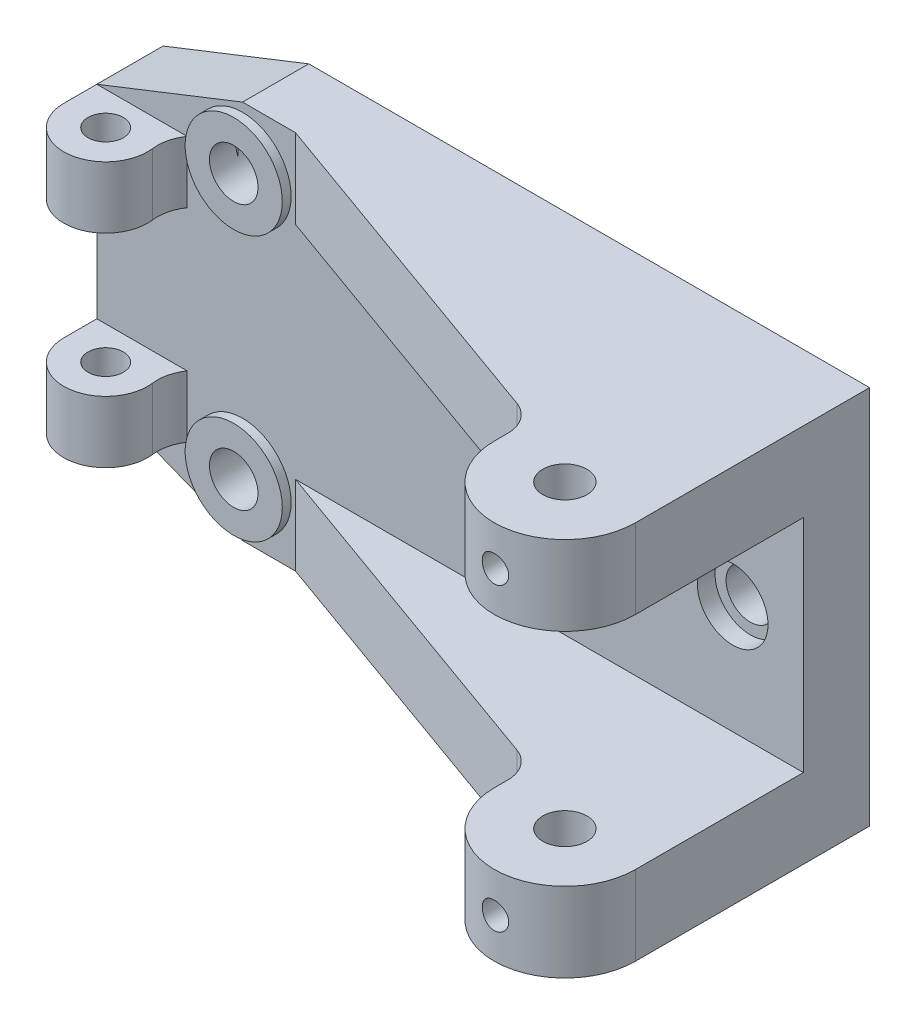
ISO-10303-21;
HEADER;
FILE_DESCRIPTION(('STEP AP214'),'2;1');
FILE_NAME('part.step','',(''),(''),'','','');
FILE_SCHEMA(('AUTOMOTIVE_DESIGN { 1 0 10303 214 1 1 1 1 }'));
ENDSEC;
DATA;
#1=APPLICATION_CONTEXT('core data for automotive mechanical design processes');
#2=APPLICATION_PROTOCOL_DEFINITION('international standard','automotive_design',2000,#1);
#3=PRODUCT_CONTEXT('',#1,'mechanical');
#4=PRODUCT('Part','Part','',(#3));
#5=PRODUCT_RELATED_PRODUCT_CATEGORY('part','',(#4));
#6=PRODUCT_DEFINITION_FORMATION('','',#4);
#7=PRODUCT_DEFINITION_CONTEXT('part definition',#1,'design');
#8=PRODUCT_DEFINITION('design','',#6,#7);
#9=PRODUCT_DEFINITION_SHAPE('','',#8);
#10=(LENGTH_UNIT() NAMED_UNIT(*) SI_UNIT(.MILLI.,.METRE.));
#11=(NAMED_UNIT(*) PLANE_ANGLE_UNIT() SI_UNIT($,.RADIAN.));
#12=(NAMED_UNIT(*) SI_UNIT($,.STERADIAN.) SOLID_ANGLE_UNIT());
#13=UNCERTAINTY_MEASURE_WITH_UNIT(LENGTH_MEASURE(1.E-05),#10,'distance_accuracy_value','');
#14=(GEOMETRIC_REPRESENTATION_CONTEXT(3) GLOBAL_UNCERTAINTY_ASSIGNED_CONTEXT((#13)) GLOBAL_UNIT_ASSIGNED_CONTEXT((#10,
#11,#12)) REPRESENTATION_CONTEXT('',''));
#15=CARTESIAN_POINT('',(0.,0.,0.));
#16=DIRECTION('',(0.,0.,1.));
#17=DIRECTION('',(1.,0.,0.));
#18=AXIS2_PLACEMENT_3D('',#15,#16,#17);
#19=CARTESIAN_POINT('',(-16.,86.,53.));
#20=DIRECTION('',(0.,-1.,0.));
#21=DIRECTION('',(0.,0.,-1.));
#22=AXIS2_PLACEMENT_3D('',#19,#20,#21);
#23=CYLINDRICAL_SURFACE('',#22,16.);
#24=DIRECTION('',(0.,-1.,0.));
#25=VECTOR('',#24,1.);
#26=CARTESIAN_POINT('',(0.,86.,53.));
#27=LINE('',#26,#25);
#28=CARTESIAN_POINT('',(0.,86.,53.));
#29=VERTEX_POINT('',#28);
#30=CARTESIAN_POINT('',(0.,68.,53.));
#31=VERTEX_POINT('',#30);
#32=EDGE_CURVE('E323',#29,#31,#27,.T.);
#33=ORIENTED_EDGE('',*,*,#32,.F.);
#34=CARTESIAN_POINT('',(-16.,86.,53.));
#35=DIRECTION('',(0.,-1.,0.));
#36=DIRECTION('',(0.,0.,-1.));
#37=AXIS2_PLACEMENT_3D('',#34,#35,#36);
#38=CIRCLE('',#37,16.);
#39=CARTESIAN_POINT('',(-32.,86.,53.));
#40=VERTEX_POINT('',#39);
#41=EDGE_CURVE('E311',#29,#40,#38,.T.);
#42=ORIENTED_EDGE('',*,*,#41,.T.);
#43=DIRECTION('',(0.,-1.,0.));
#44=VECTOR('',#43,1.);
#45=CARTESIAN_POINT('',(-32.,86.,53.));
#46=LINE('',#45,#44);
#47=CARTESIAN_POINT('',(-32.,68.,53.));
#48=VERTEX_POINT('',#47);
#49=EDGE_CURVE('E325',#40,#48,#46,.T.);
#50=ORIENTED_EDGE('',*,*,#49,.T.);
#51=CARTESIAN_POINT('',(-16.,68.,53.));
#52=DIRECTION('',(0.,-1.,0.));
#53=DIRECTION('',(0.,0.,-1.));
#54=AXIS2_PLACEMENT_3D('',#51,#52,#53);
#55=CIRCLE('',#54,16.);
#56=EDGE_CURVE('E299',#31,#48,#55,.T.);
#57=ORIENTED_EDGE('',*,*,#56,.F.);
#58=EDGE_LOOP('',(#33,#42,#50,#57));
#59=FACE_BOUND('',#58,.T.);
#60=CARTESIAN_POINT('',(-19.,77.,68.7162336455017));
#61=CARTESIAN_POINT('',(-18.9999935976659,76.8330855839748,68.7162368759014));
#62=CARTESIAN_POINT('',(-18.986022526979,76.6660881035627,68.7189215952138));
#63=CARTESIAN_POINT('',(-18.9305450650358,76.3368020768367,68.7293570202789));
#64=CARTESIAN_POINT('',(-18.8890153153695,76.1745176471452,68.7371120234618));
#65=CARTESIAN_POINT('',(-18.7797407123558,75.8594698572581,68.7567795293));
#66=CARTESIAN_POINT('',(-18.7120202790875,75.7066977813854,68.7686881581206));
#67=CARTESIAN_POINT('',(-18.5523513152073,75.4146928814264,68.7953165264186));
#68=CARTESIAN_POINT('',(-18.4604046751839,75.2754590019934,68.8100360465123));
#69=CARTESIAN_POINT('',(-18.2536735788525,75.0127396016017,68.8408322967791));
#70=CARTESIAN_POINT('',(-18.1386458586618,74.8894470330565,68.8569223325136));
#71=CARTESIAN_POINT('',(-17.8895435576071,74.6637912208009,68.8885291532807));
#72=CARTESIAN_POINT('',(-17.7554677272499,74.5614293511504,68.9040459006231));
#73=CARTESIAN_POINT('',(-17.4708077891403,74.379801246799,68.9329003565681));
#74=CARTESIAN_POINT('',(-17.3201056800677,74.3007169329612,68.9462205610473));
#75=CARTESIAN_POINT('',(-17.0072625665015,74.1690609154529,68.9690321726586));
#76=CARTESIAN_POINT('',(-16.845122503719,74.1164870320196,68.9785238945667));
#77=CARTESIAN_POINT('',(-16.5160054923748,74.0399409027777,68.9925151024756));
#78=CARTESIAN_POINT('',(-16.3491066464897,74.0156433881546,68.9970713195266));
#79=CARTESIAN_POINT('',(-16.0135433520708,73.9953262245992,69.0008736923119));
#80=CARTESIAN_POINT('',(-15.8448790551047,73.9993041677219,69.000120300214));
#81=CARTESIAN_POINT('',(-15.5128032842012,74.0351755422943,68.9934326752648));
#82=CARTESIAN_POINT('',(-15.3493524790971,74.06671873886,68.9875634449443));
#83=CARTESIAN_POINT('',(-15.0301056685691,74.1562712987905,68.9713765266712));
#84=CARTESIAN_POINT('',(-14.8743099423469,74.2142816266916,68.9610586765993));
#85=CARTESIAN_POINT('',(-14.573779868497,74.3554554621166,68.9370252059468));
#86=CARTESIAN_POINT('',(-14.4291128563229,74.438758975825,68.9232907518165));
#87=CARTESIAN_POINT('',(-14.1556800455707,74.6280513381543,68.893942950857));
#88=CARTESIAN_POINT('',(-14.0269158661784,74.7340424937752,68.8783294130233));
#89=CARTESIAN_POINT('',(-13.7868687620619,74.9676314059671,68.8466702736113));
#90=CARTESIAN_POINT('',(-13.6758841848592,75.0955355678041,68.8306217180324));
#91=CARTESIAN_POINT('',(-13.4768965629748,75.3682990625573,68.8001301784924));
#92=CARTESIAN_POINT('',(-13.3888938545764,75.5131586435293,68.785687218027));
#93=CARTESIAN_POINT('',(-13.2382829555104,75.8161165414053,68.7600378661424));
#94=CARTESIAN_POINT('',(-13.1757181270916,75.9742369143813,68.7488370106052));
#95=CARTESIAN_POINT('',(-13.0781268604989,76.2990023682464,68.7310248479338));
#96=CARTESIAN_POINT('',(-13.0430973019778,76.4656464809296,68.7244130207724));
#97=CARTESIAN_POINT('',(-13.0020065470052,76.8000386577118,68.7166304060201));
#98=CARTESIAN_POINT('',(-12.9955167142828,76.967732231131,68.7153791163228));
#99=CARTESIAN_POINT('',(-13.0105406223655,77.3018069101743,68.7182438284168));
#100=CARTESIAN_POINT('',(-13.0320529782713,77.4681880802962,68.7223595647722));
#101=CARTESIAN_POINT('',(-13.1021026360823,77.7935058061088,68.7354196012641));
#102=CARTESIAN_POINT('',(-13.1504152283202,77.9524925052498,68.7443237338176));
#103=CARTESIAN_POINT('',(-13.2724555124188,78.2601143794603,68.7659226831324));
#104=CARTESIAN_POINT('',(-13.3461850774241,78.4087487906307,68.7786177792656));
#105=CARTESIAN_POINT('',(-13.5179529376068,78.6933352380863,68.8065515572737));
#106=CARTESIAN_POINT('',(-13.6162620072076,78.8291210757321,68.8218179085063));
#107=CARTESIAN_POINT('',(-13.8340331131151,79.0824240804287,68.853096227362));
#108=CARTESIAN_POINT('',(-13.9534970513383,79.1999396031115,68.8691082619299));
#109=CARTESIAN_POINT('',(-14.2121011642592,79.4149675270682,68.9003324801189));
#110=CARTESIAN_POINT('',(-14.3514829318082,79.5121916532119,68.9155311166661));
#111=CARTESIAN_POINT('',(-14.6448509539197,79.6818424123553,68.943188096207));
#112=CARTESIAN_POINT('',(-14.7988366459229,79.75427000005,68.9556465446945));
#113=CARTESIAN_POINT('',(-15.1162449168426,79.8718401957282,68.9763611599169));
#114=CARTESIAN_POINT('',(-15.279613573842,79.9171243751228,68.9846390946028));
#115=CARTESIAN_POINT('',(-15.6118075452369,79.9795740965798,68.996152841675));
#116=CARTESIAN_POINT('',(-15.7806322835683,79.9967425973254,68.9993891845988));
#117=CARTESIAN_POINT('',(-16.116181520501,80.0023706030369,69.0004445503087));
#118=CARTESIAN_POINT('',(-16.2828986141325,79.9912655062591,68.9983457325));
#119=CARTESIAN_POINT('',(-16.6120467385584,79.9416151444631,68.9891373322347));
#120=CARTESIAN_POINT('',(-16.7744778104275,79.9030701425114,68.9820277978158));
#121=CARTESIAN_POINT('',(-17.0902129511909,79.7998175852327,68.9635967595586));
#122=CARTESIAN_POINT('',(-17.2435326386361,79.7351563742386,68.9522827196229));
#123=CARTESIAN_POINT('',(-17.5372112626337,79.5815590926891,68.9266674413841));
#124=CARTESIAN_POINT('',(-17.6775693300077,79.4926213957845,68.912366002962));
#125=CARTESIAN_POINT('',(-17.9435100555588,79.2914970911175,68.8820955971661));
#126=CARTESIAN_POINT('',(-18.0688524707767,79.1789959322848,68.8661056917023));
#127=CARTESIAN_POINT('',(-18.2990307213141,78.9345908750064,68.8343926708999));
#128=CARTESIAN_POINT('',(-18.403861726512,78.8026824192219,68.8186696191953));
#129=CARTESIAN_POINT('',(-18.590952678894,78.5217470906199,68.7891115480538));
#130=CARTESIAN_POINT('',(-18.6729948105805,78.3725731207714,68.7752953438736));
#131=CARTESIAN_POINT('',(-18.8107226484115,78.0623484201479,68.7513416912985));
#132=CARTESIAN_POINT('',(-18.8664332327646,77.9013090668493,68.7412007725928));
#133=CARTESIAN_POINT('',(-18.9385945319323,77.6164954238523,68.7278603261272));
#134=CARTESIAN_POINT('',(-18.9615821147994,77.4943885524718,68.7235262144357));
#135=CARTESIAN_POINT('',(-18.9922870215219,77.2482030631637,68.7177117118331));
#136=CARTESIAN_POINT('',(-19.0000047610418,77.1241244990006,68.7162312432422));
#137=CARTESIAN_POINT('',(-19.,77.,68.7162336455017));
#138=B_SPLINE_CURVE_WITH_KNOTS('',3,(#60,#61,#62,#63,#64,#65,#66,#67,#68,#69,#70,#71,#72,#73,
#74,#75,#76,#77,#78,#79,#80,#81,#82,#83,#84,#85,#86,#87,#88,#89,#90,#91,#92,#93,#94,#95,#96,#97,
#98,#99,#100,#101,#102,#103,#104,#105,#106,#107,#108,#109,#110,#111,#112,#113,#114,#115,#116,
#117,#118,#119,#120,#121,#122,#123,#124,#125,#126,#127,#128,#129,#130,#131,#132,#133,#134,#135,
#136,#137),.UNSPECIFIED.,.T.,.F.,(4,2,2,2,2,2,2,2,2,2,2,2,2,2,2,2,2,2,2,2,2,2,2,2,2,2,2,2,2,2,2,
2,2,2,2,2,2,2,4),(0.,0.500289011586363,1.00100260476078,1.50125045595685,2.00145927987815,
2.50724671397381,3.01306734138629,3.52274208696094,4.0323749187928,4.53608550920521,
5.03975320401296,5.53711301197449,6.03449094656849,6.53467383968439,7.0349076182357,
7.54281229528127,8.05072440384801,8.55949872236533,9.06821537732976,9.5692649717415,
10.0702897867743,10.5671758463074,11.0640985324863,11.5667572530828,12.0694611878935,
12.5788825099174,13.0882842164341,13.5950053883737,14.1016732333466,14.6005860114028,
15.0994940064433,15.5975205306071,16.0955804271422,16.6007692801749,17.1060769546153,
17.6160600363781,18.1255603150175,18.4976061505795,18.8696418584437),.UNSPECIFIED.);
#139=CARTESIAN_POINT('',(-19.,77.,68.7162336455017));
#140=VERTEX_POINT('',#139);
#141=EDGE_CURVE('E618',#140,#140,#138,.T.);
#142=ORIENTED_EDGE('',*,*,#141,.F.);
#143=EDGE_LOOP('',(#142));
#144=FACE_BOUND('',#143,.T.);
#145=ADVANCED_FACE('F26',(#59,#144),#23,.T.);
#146=CARTESIAN_POINT('',(-16.,86.,53.));
#147=DIRECTION('',(0.,-1.,0.));
#148=DIRECTION('',(0.,0.,-1.));
#149=AXIS2_PLACEMENT_3D('',#146,#147,#148);
#150=CYLINDRICAL_SURFACE('',#149,5.);
#151=CARTESIAN_POINT('',(-16.,86.,53.));
#152=DIRECTION('',(0.,-1.,0.));
#153=DIRECTION('',(0.,0.,-1.));
#154=AXIS2_PLACEMENT_3D('',#151,#152,#153);
#155=CIRCLE('',#154,5.);
#156=CARTESIAN_POINT('',(-16.,86.,48.));
#157=VERTEX_POINT('',#156);
#158=EDGE_CURVE('E286',#157,#157,#155,.T.);
#159=ORIENTED_EDGE('',*,*,#158,.F.);
#160=EDGE_LOOP('',(#159));
#161=FACE_BOUND('',#160,.T.);
#162=CARTESIAN_POINT('',(-16.,68.,53.));
#163=DIRECTION('',(0.,-1.,0.));
#164=DIRECTION('',(0.,0.,-1.));
#165=AXIS2_PLACEMENT_3D('',#162,#163,#164);
#166=CIRCLE('',#165,5.);
#167=CARTESIAN_POINT('',(-16.,68.,48.));
#168=VERTEX_POINT('',#167);
#169=EDGE_CURVE('E289',#168,#168,#166,.T.);
#170=ORIENTED_EDGE('',*,*,#169,.T.);
#171=EDGE_LOOP('',(#170));
#172=FACE_BOUND('',#171,.T.);
#173=CARTESIAN_POINT('',(-19.,77.,57.));
#174=CARTESIAN_POINT('',(-18.9999999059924,76.9245383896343,56.9999999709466));
#175=CARTESIAN_POINT('',(-18.997146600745,76.8490800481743,57.0021456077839));
#176=CARTESIAN_POINT('',(-18.9857960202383,76.6988164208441,57.0106190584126));
#177=CARTESIAN_POINT('',(-18.9772965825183,76.6240113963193,57.016948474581));
#178=CARTESIAN_POINT('',(-18.94350195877,76.4014575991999,57.0418598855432));
#179=CARTESIAN_POINT('',(-18.9099103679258,76.2555338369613,57.0663652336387));
#180=CARTESIAN_POINT('',(-18.8228688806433,75.973804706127,57.1272446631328));
#181=CARTESIAN_POINT('',(-18.7695623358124,75.8379345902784,57.1635328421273));
#182=CARTESIAN_POINT('',(-18.645058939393,75.577132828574,57.2437185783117));
#183=CARTESIAN_POINT('',(-18.5738567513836,75.4522044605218,57.287618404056));
#184=CARTESIAN_POINT('',(-18.4054234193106,75.2000986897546,57.3845721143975));
#185=CARTESIAN_POINT('',(-18.3060741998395,75.0745139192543,57.4380889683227));
#186=CARTESIAN_POINT('',(-18.088545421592,74.8404746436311,57.5445230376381));
#187=CARTESIAN_POINT('',(-17.9703517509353,74.7320330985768,57.5974397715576));
#188=CARTESIAN_POINT('',(-17.7028457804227,74.5237175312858,57.7035179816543));
#189=CARTESIAN_POINT('',(-17.5515512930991,74.4260335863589,57.7560886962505));
#190=CARTESIAN_POINT('',(-17.3113243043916,74.300253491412,57.8257056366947));
#191=CARTESIAN_POINT('',(-17.229007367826,74.2617758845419,57.8473766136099));
#192=CARTESIAN_POINT('',(-17.0604722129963,74.1922090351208,57.8870100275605));
#193=CARTESIAN_POINT('',(-16.9742566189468,74.1611149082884,57.9049749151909));
#194=CARTESIAN_POINT('',(-16.8069680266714,74.1093725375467,57.9351119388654));
#195=CARTESIAN_POINT('',(-16.7261841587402,74.0880127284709,57.9476721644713));
#196=CARTESIAN_POINT('',(-16.5626663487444,74.052050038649,57.9689232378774));
#197=CARTESIAN_POINT('',(-16.4799335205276,74.0374433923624,57.9776162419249));
#198=CARTESIAN_POINT('',(-16.3132446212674,74.0152153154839,57.9908775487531));
#199=CARTESIAN_POINT('',(-16.2292892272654,74.0075901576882,57.9954480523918));
#200=CARTESIAN_POINT('',(-16.0609397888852,73.9994333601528,58.0003394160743));
#201=CARTESIAN_POINT('',(-15.9765457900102,73.9989009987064,58.0006607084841));
#202=CARTESIAN_POINT('',(-15.7448288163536,74.0072427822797,57.9956527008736));
#203=CARTESIAN_POINT('',(-15.5977800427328,74.0234711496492,57.9859047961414));
#204=CARTESIAN_POINT('',(-15.3090437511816,74.0769554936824,57.9541639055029));
#205=CARTESIAN_POINT('',(-15.1673566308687,74.1142130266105,57.9321700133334));
#206=CARTESIAN_POINT('',(-14.8918939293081,74.208332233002,57.8776970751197));
#207=CARTESIAN_POINT('',(-14.7581690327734,74.2653064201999,57.8451579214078));
#208=CARTESIAN_POINT('',(-14.5020206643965,74.3967689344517,57.7721930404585));
#209=CARTESIAN_POINT('',(-14.3796001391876,74.4712618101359,57.7317652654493));
#210=CARTESIAN_POINT('',(-14.1338521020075,74.6456782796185,57.6407584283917));
#211=CARTESIAN_POINT('',(-14.0121628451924,74.7475766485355,57.589543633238));
#212=CARTESIAN_POINT('',(-13.7865705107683,74.9688082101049,57.4851111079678));
#213=CARTESIAN_POINT('',(-13.6826919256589,75.0881649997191,57.4318907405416));
#214=CARTESIAN_POINT('',(-13.4835032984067,75.3573068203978,57.3222214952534));
#215=CARTESIAN_POINT('',(-13.3905813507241,75.5090151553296,57.2661132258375));
#216=CARTESIAN_POINT('',(-13.2320556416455,75.8294124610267,57.1650175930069));
#217=CARTESIAN_POINT('',(-13.1664015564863,75.9980694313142,57.120009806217));
#218=CARTESIAN_POINT('',(-13.0784500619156,76.3047872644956,57.0579173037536));
#219=CARTESIAN_POINT('',(-13.0494419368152,76.4400812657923,57.0366777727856));
#220=CARTESIAN_POINT('',(-13.0103825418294,76.7147472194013,57.0078430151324));
#221=CARTESIAN_POINT('',(-13.0003092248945,76.8541142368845,57.0002319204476));
#222=CARTESIAN_POINT('',(-12.9997043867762,77.1331033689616,56.9997782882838));
#223=CARTESIAN_POINT('',(-13.0091999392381,77.2727255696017,57.0069562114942));
#224=CARTESIAN_POINT('',(-13.0471941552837,77.5479746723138,57.0350304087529));
#225=CARTESIAN_POINT('',(-13.0757078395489,77.6835983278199,57.055937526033));
#226=CARTESIAN_POINT('',(-13.1502338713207,77.9474292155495,57.1086353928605));
#227=CARTESIAN_POINT('',(-13.1962243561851,78.0756454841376,57.1404125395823));
#228=CARTESIAN_POINT('',(-13.304074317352,78.3229552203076,57.2114306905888));
#229=CARTESIAN_POINT('',(-13.3659397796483,78.4420452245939,57.2506745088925));
#230=CARTESIAN_POINT('',(-13.5166532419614,78.6904810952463,57.3407368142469));
#231=CARTESIAN_POINT('',(-13.608354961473,78.8178054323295,57.3923665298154));
#232=CARTESIAN_POINT('',(-13.8102438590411,79.0565672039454,57.4964333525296));
#233=CARTESIAN_POINT('',(-13.9204487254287,79.1679892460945,57.5488711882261));
#234=CARTESIAN_POINT('',(-14.1734852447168,79.3864639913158,57.6567199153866));
#235=CARTESIAN_POINT('',(-14.3186960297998,79.4910647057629,57.7116308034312));
#236=CARTESIAN_POINT('',(-14.5505536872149,79.6281544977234,57.7859945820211));
#237=CARTESIAN_POINT('',(-14.6302139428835,79.6705620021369,57.8094564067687));
#238=CARTESIAN_POINT('',(-14.7937634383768,79.7483038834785,57.8530540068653));
#239=CARTESIAN_POINT('',(-14.8776499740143,79.7836427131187,57.8731918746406));
#240=CARTESIAN_POINT('',(-15.0428593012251,79.8444796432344,57.9082066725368));
#241=CARTESIAN_POINT('',(-15.123930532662,79.8705037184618,57.9233583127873));
#242=CARTESIAN_POINT('',(-15.2885393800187,79.9156649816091,57.9498249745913));
#243=CARTESIAN_POINT('',(-15.3720755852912,79.9348060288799,57.9611421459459));
#244=CARTESIAN_POINT('',(-15.5408803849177,79.9659003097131,57.9795990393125));
#245=CARTESIAN_POINT('',(-15.626147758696,79.9778584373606,57.9867416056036));
#246=CARTESIAN_POINT('',(-15.7976158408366,79.994406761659,57.996642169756));
#247=CARTESIAN_POINT('',(-15.8838164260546,79.9989979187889,57.9994007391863));
#248=CARTESIAN_POINT('',(-16.1195193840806,80.0013282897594,58.0007935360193));
#249=CARTESIAN_POINT('',(-16.2692131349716,79.9916010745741,57.9949361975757));
#250=CARTESIAN_POINT('',(-16.5643255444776,79.9502179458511,57.9702639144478));
#251=CARTESIAN_POINT('',(-16.7097441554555,79.9185617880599,57.951448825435));
#252=CARTESIAN_POINT('',(-16.9902836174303,79.8355594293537,57.9029872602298));
#253=CARTESIAN_POINT('',(-17.1255320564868,79.784536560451,57.873519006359));
#254=CARTESIAN_POINT('',(-17.3855659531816,79.6647190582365,57.8060670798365));
#255=CARTESIAN_POINT('',(-17.510349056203,79.5959204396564,57.7680814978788));
#256=CARTESIAN_POINT('',(-17.7605265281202,79.4341500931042,57.6818686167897));
#257=CARTESIAN_POINT('',(-17.884516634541,79.3393649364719,57.6329771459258));
#258=CARTESIAN_POINT('',(-18.1157957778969,79.1324915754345,57.5320378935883));
#259=CARTESIAN_POINT('',(-18.2230660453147,79.0203842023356,57.4799866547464));
#260=CARTESIAN_POINT('',(-18.4318169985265,78.7654389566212,57.3705644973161));
#261=CARTESIAN_POINT('',(-18.5308384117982,78.6205069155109,57.3133560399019));
#262=CARTESIAN_POINT('',(-18.7031460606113,78.3129904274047,57.207524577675));
#263=CARTESIAN_POINT('',(-18.7764456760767,78.1504152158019,57.1588971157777));
#264=CARTESIAN_POINT('',(-18.8619348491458,77.9033774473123,57.1000473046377));
#265=CARTESIAN_POINT('',(-18.8857123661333,77.8243414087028,57.0832950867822));
#266=CARTESIAN_POINT('',(-18.9267938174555,77.6638695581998,57.0539508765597));
#267=CARTESIAN_POINT('',(-18.9441018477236,77.5824353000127,57.0413562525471));
#268=CARTESIAN_POINT('',(-18.9719122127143,77.4179534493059,57.0209497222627));
#269=CARTESIAN_POINT('',(-18.9824253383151,77.3349086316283,57.0131302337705));
#270=CARTESIAN_POINT('',(-18.9964688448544,77.1679077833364,57.0026557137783));
#271=CARTESIAN_POINT('',(-19.0000001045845,77.0839518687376,57.0000000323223));
#272=CARTESIAN_POINT('',(-19.,77.,57.));
#273=B_SPLINE_CURVE_WITH_KNOTS('',3,(#173,#174,#175,#176,#177,#178,#179,#180,#181,#182,#183,
#184,#185,#186,#187,#188,#189,#190,#191,#192,#193,#194,#195,#196,#197,#198,#199,#200,#201,#202,
#203,#204,#205,#206,#207,#208,#209,#210,#211,#212,#213,#214,#215,#216,#217,#218,#219,#220,#221,
#222,#223,#224,#225,#226,#227,#228,#229,#230,#231,#232,#233,#234,#235,#236,#237,#238,#239,#240,
#241,#242,#243,#244,#245,#246,#247,#248,#249,#250,#251,#252,#253,#254,#255,#256,#257,#258,#259,
#260,#261,#262,#263,#264,#265,#266,#267,#268,#269,#270,#271,#272),.UNSPECIFIED.,.T.,.F.,(4,2,2,
2,2,2,2,2,2,2,2,2,2,2,2,2,2,2,2,2,2,2,2,2,2,2,2,2,2,2,2,2,2,2,2,2,2,2,2,2,2,2,2,2,2,2,2,2,2,4),
(0.,0.226288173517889,0.452663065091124,0.905305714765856,1.35471981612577,1.80426809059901,
2.30878181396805,2.81367513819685,3.37309572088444,3.65297634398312,3.93267130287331,
4.18580566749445,4.43879871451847,4.69165661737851,4.94448879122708,5.38694235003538,
5.82942865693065,6.27448283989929,6.71965270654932,7.2179959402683,7.71701907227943,
8.2738731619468,8.82969494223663,9.24786570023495,9.66554925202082,10.0838110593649,
10.5024036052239,10.9204742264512,11.3387027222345,11.8323285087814,12.3264288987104,
12.8847762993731,13.1641700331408,13.4433872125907,13.7024631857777,13.9613936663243,
14.2201475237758,14.4788676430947,14.9267946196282,15.3747265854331,15.8154875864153,
16.2563474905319,16.7450674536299,17.2343321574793,17.7856420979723,18.3366648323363,
18.5890061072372,18.8411873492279,19.0929671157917,19.3447151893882),.UNSPECIFIED.);
#274=CARTESIAN_POINT('',(-19.,77.,57.));
#275=VERTEX_POINT('',#274);
#276=EDGE_CURVE('E621',#275,#275,#273,.T.);
#277=ORIENTED_EDGE('',*,*,#276,.T.);
#278=EDGE_LOOP('',(#277));
#279=FACE_BOUND('',#278,.T.);
#280=ADVANCED_FACE('F489',(#161,#172,#279),#150,.F.);
#281=CARTESIAN_POINT('',(-16.,18.,53.));
#282=DIRECTION('',(0.,-1.,0.));
#283=DIRECTION('',(0.,0.,-1.));
#284=AXIS2_PLACEMENT_3D('',#281,#282,#283);
#285=CYLINDRICAL_SURFACE('',#284,16.);
#286=DIRECTION('',(0.,-1.,0.));
#287=VECTOR('',#286,1.);
#288=CARTESIAN_POINT('',(0.,18.,53.));
#289=LINE('',#288,#287);
#290=CARTESIAN_POINT('',(0.,18.,53.));
#291=VERTEX_POINT('',#290);
#292=CARTESIAN_POINT('',(0.,0.,53.));
#293=VERTEX_POINT('',#292);
#294=EDGE_CURVE('E364',#291,#293,#289,.T.);
#295=ORIENTED_EDGE('',*,*,#294,.F.);
#296=CARTESIAN_POINT('',(-16.,18.,53.));
#297=DIRECTION('',(0.,-1.,0.));
#298=DIRECTION('',(0.,0.,-1.));
#299=AXIS2_PLACEMENT_3D('',#296,#297,#298);
#300=CIRCLE('',#299,16.);
#301=CARTESIAN_POINT('',(-32.,18.,53.));
#302=VERTEX_POINT('',#301);
#303=EDGE_CURVE('E352',#291,#302,#300,.T.);
#304=ORIENTED_EDGE('',*,*,#303,.T.);
#305=DIRECTION('',(0.,-1.,0.));
#306=VECTOR('',#305,1.);
#307=CARTESIAN_POINT('',(-32.,18.,53.));
#308=LINE('',#307,#306);
#309=CARTESIAN_POINT('',(-32.,0.,53.));
#310=VERTEX_POINT('',#309);
#311=EDGE_CURVE('E367',#302,#310,#308,.T.);
#312=ORIENTED_EDGE('',*,*,#311,.T.);
#313=CARTESIAN_POINT('',(-16.,0.,53.));
#314=DIRECTION('',(0.,-1.,0.));
#315=DIRECTION('',(0.,0.,-1.));
#316=AXIS2_PLACEMENT_3D('',#313,#314,#315);
#317=CIRCLE('',#316,16.);
#318=EDGE_CURVE('E334',#293,#310,#317,.T.);
#319=ORIENTED_EDGE('',*,*,#318,.F.);
#320=EDGE_LOOP('',(#295,#304,#312,#319));
#321=FACE_BOUND('',#320,.T.);
#322=CARTESIAN_POINT('',(-19.,9.,68.7162336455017));
#323=CARTESIAN_POINT('',(-18.9999935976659,8.83308558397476,68.7162368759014));
#324=CARTESIAN_POINT('',(-18.986022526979,8.66608810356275,68.7189215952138));
#325=CARTESIAN_POINT('',(-18.9305450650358,8.33680207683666,68.7293570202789));
#326=CARTESIAN_POINT('',(-18.8890153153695,8.17451764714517,68.7371120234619));
#327=CARTESIAN_POINT('',(-18.7797407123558,7.85946985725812,68.7567795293));
#328=CARTESIAN_POINT('',(-18.7120202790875,7.70669778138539,68.7686881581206));
#329=CARTESIAN_POINT('',(-18.5523513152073,7.41469288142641,68.7953165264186));
#330=CARTESIAN_POINT('',(-18.4604046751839,7.2754590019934,68.8100360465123));
#331=CARTESIAN_POINT('',(-18.2536735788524,7.01273960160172,68.8408322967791));
#332=CARTESIAN_POINT('',(-18.1386458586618,6.88944703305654,68.8569223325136));
#333=CARTESIAN_POINT('',(-17.8895435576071,6.66379122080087,68.8885291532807));
#334=CARTESIAN_POINT('',(-17.7554677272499,6.56142935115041,68.9040459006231));
#335=CARTESIAN_POINT('',(-17.4708077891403,6.37980124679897,68.9329003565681));
#336=CARTESIAN_POINT('',(-17.3201056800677,6.30071693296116,68.9462205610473));
#337=CARTESIAN_POINT('',(-17.0072625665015,6.16906091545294,68.9690321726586));
#338=CARTESIAN_POINT('',(-16.845122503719,6.11648703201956,68.9785238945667));
#339=CARTESIAN_POINT('',(-16.5160054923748,6.03994090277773,68.9925151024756));
#340=CARTESIAN_POINT('',(-16.3491066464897,6.01564338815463,68.9970713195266));
#341=CARTESIAN_POINT('',(-16.0135433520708,5.9953262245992,69.0008736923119));
#342=CARTESIAN_POINT('',(-15.8448790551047,5.99930416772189,69.000120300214));
#343=CARTESIAN_POINT('',(-15.5128032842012,6.0351755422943,68.9934326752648));
#344=CARTESIAN_POINT('',(-15.3493524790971,6.06671873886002,68.9875634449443));
#345=CARTESIAN_POINT('',(-15.030105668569,6.15627129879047,68.9713765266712));
#346=CARTESIAN_POINT('',(-14.8743099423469,6.21428162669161,68.9610586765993));
#347=CARTESIAN_POINT('',(-14.573779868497,6.3554554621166,68.9370252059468));
#348=CARTESIAN_POINT('',(-14.4291128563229,6.438758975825,68.9232907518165));
#349=CARTESIAN_POINT('',(-14.1556800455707,6.62805133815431,68.893942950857));
#350=CARTESIAN_POINT('',(-14.0269158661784,6.73404249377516,68.8783294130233));
#351=CARTESIAN_POINT('',(-13.7868687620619,6.96763140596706,68.8466702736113));
#352=CARTESIAN_POINT('',(-13.6758841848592,7.09553556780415,68.8306217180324));
#353=CARTESIAN_POINT('',(-13.4768965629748,7.36829906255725,68.8001301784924));
#354=CARTESIAN_POINT('',(-13.3888938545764,7.51315864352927,68.785687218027));
#355=CARTESIAN_POINT('',(-13.2382829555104,7.81611654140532,68.7600378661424));
#356=CARTESIAN_POINT('',(-13.1757181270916,7.97423691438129,68.7488370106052));
#357=CARTESIAN_POINT('',(-13.0781268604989,8.2990023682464,68.7310248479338));
#358=CARTESIAN_POINT('',(-13.0430973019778,8.46564648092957,68.7244130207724));
#359=CARTESIAN_POINT('',(-13.0020065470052,8.80003865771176,68.7166304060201));
#360=CARTESIAN_POINT('',(-12.9955167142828,8.96773223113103,68.7153791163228));
#361=CARTESIAN_POINT('',(-13.0105406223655,9.3018069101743,68.7182438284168));
#362=CARTESIAN_POINT('',(-13.0320529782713,9.46818808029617,68.7223595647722));
#363=CARTESIAN_POINT('',(-13.1021026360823,9.79350580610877,68.7354196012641));
#364=CARTESIAN_POINT('',(-13.1504152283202,9.95249250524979,68.7443237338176));
#365=CARTESIAN_POINT('',(-13.2724555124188,10.2601143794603,68.7659226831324));
#366=CARTESIAN_POINT('',(-13.3461850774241,10.4087487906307,68.7786177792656));
#367=CARTESIAN_POINT('',(-13.5179529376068,10.6933352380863,68.8065515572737));
#368=CARTESIAN_POINT('',(-13.6162620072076,10.8291210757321,68.8218179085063));
#369=CARTESIAN_POINT('',(-13.8340331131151,11.0824240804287,68.853096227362));
#370=CARTESIAN_POINT('',(-13.9534970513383,11.1999396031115,68.8691082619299));
#371=CARTESIAN_POINT('',(-14.2121011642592,11.4149675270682,68.9003324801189));
#372=CARTESIAN_POINT('',(-14.3514829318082,11.5121916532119,68.9155311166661));
#373=CARTESIAN_POINT('',(-14.6448509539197,11.6818424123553,68.943188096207));
#374=CARTESIAN_POINT('',(-14.7988366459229,11.75427000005,68.9556465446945));
#375=CARTESIAN_POINT('',(-15.1162449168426,11.8718401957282,68.9763611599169));
#376=CARTESIAN_POINT('',(-15.279613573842,11.9171243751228,68.9846390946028));
#377=CARTESIAN_POINT('',(-15.6118075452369,11.9795740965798,68.996152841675));
#378=CARTESIAN_POINT('',(-15.7806322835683,11.9967425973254,68.9993891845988));
#379=CARTESIAN_POINT('',(-16.116181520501,12.0023706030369,69.0004445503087));
#380=CARTESIAN_POINT('',(-16.2828986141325,11.9912655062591,68.9983457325));
#381=CARTESIAN_POINT('',(-16.6120467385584,11.9416151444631,68.9891373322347));
#382=CARTESIAN_POINT('',(-16.7744778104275,11.9030701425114,68.9820277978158));
#383=CARTESIAN_POINT('',(-17.0902129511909,11.7998175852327,68.9635967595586));
#384=CARTESIAN_POINT('',(-17.2435326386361,11.7351563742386,68.9522827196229));
#385=CARTESIAN_POINT('',(-17.5372112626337,11.5815590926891,68.9266674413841));
#386=CARTESIAN_POINT('',(-17.6775693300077,11.4926213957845,68.912366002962));
#387=CARTESIAN_POINT('',(-17.9435100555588,11.2914970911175,68.8820955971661));
#388=CARTESIAN_POINT('',(-18.0688524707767,11.1789959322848,68.8661056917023));
#389=CARTESIAN_POINT('',(-18.2990307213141,10.9345908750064,68.8343926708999));
#390=CARTESIAN_POINT('',(-18.403861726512,10.8026824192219,68.8186696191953));
#391=CARTESIAN_POINT('',(-18.590952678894,10.5217470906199,68.7891115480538));
#392=CARTESIAN_POINT('',(-18.6729948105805,10.3725731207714,68.7752953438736));
#393=CARTESIAN_POINT('',(-18.8107226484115,10.0623484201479,68.7513416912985));
#394=CARTESIAN_POINT('',(-18.8664332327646,9.90130906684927,68.7412007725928));
#395=CARTESIAN_POINT('',(-18.9385945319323,9.61649542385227,68.7278603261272));
#396=CARTESIAN_POINT('',(-18.9615821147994,9.49438855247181,68.7235262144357));
#397=CARTESIAN_POINT('',(-18.9922870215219,9.24820306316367,68.7177117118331));
#398=CARTESIAN_POINT('',(-19.0000047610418,9.12412449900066,68.7162312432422));
#399=CARTESIAN_POINT('',(-19.,9.,68.7162336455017));
#400=B_SPLINE_CURVE_WITH_KNOTS('',3,(#322,#323,#324,#325,#326,#327,#328,#329,#330,#331,#332,
#333,#334,#335,#336,#337,#338,#339,#340,#341,#342,#343,#344,#345,#346,#347,#348,#349,#350,#351,
#352,#353,#354,#355,#356,#357,#358,#359,#360,#361,#362,#363,#364,#365,#366,#367,#368,#369,#370,
#371,#372,#373,#374,#375,#376,#377,#378,#379,#380,#381,#382,#383,#384,#385,#386,#387,#388,#389,
#390,#391,#392,#393,#394,#395,#396,#397,#398,#399),.UNSPECIFIED.,.T.,.F.,(4,2,2,2,2,2,2,2,2,2,2,
2,2,2,2,2,2,2,2,2,2,2,2,2,2,2,2,2,2,2,2,2,2,2,2,2,2,2,4),(0.,0.500289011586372,1.00100260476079,
1.50125045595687,2.00145927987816,2.50724671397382,3.01306734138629,3.52274208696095,
4.0323749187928,4.53608550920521,5.03975320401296,5.53711301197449,6.03449094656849,
6.53467383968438,7.03490761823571,7.54281229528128,8.050724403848,8.55949872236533,
9.06821537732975,9.5692649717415,10.0702897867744,10.5671758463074,11.0640985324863,
11.5667572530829,12.0694611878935,12.5788825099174,13.0882842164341,13.5950053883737,
14.1016732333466,14.6005860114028,15.0994940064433,15.5975205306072,16.0955804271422,
16.6007692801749,17.1060769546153,17.6160600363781,18.1255603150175,18.4976061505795,
18.8696418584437),.UNSPECIFIED.);
#401=CARTESIAN_POINT('',(-19.,9.,68.7162336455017));
#402=VERTEX_POINT('',#401);
#403=EDGE_CURVE('E624',#402,#402,#400,.T.);
#404=ORIENTED_EDGE('',*,*,#403,.F.);
#405=EDGE_LOOP('',(#404));
#406=FACE_BOUND('',#405,.T.);
#407=ADVANCED_FACE('F492',(#321,#406),#285,.T.);
#408=CARTESIAN_POINT('',(-16.,18.,53.));
#409=DIRECTION('',(0.,-1.,0.));
#410=DIRECTION('',(0.,0.,-1.));
#411=AXIS2_PLACEMENT_3D('',#408,#409,#410);
#412=CIRCLE('',#411,5.);
#413=CARTESIAN_POINT('',(-16.,18.,48.));
#414=VERTEX_POINT('',#413);
#415=EDGE_CURVE('E290',#414,#414,#412,.T.);
#416=ORIENTED_EDGE('',*,*,#415,.F.);
#417=EDGE_LOOP('',(#416));
#418=FACE_BOUND('',#417,.T.);
#419=CARTESIAN_POINT('',(-16.,0.,53.));
#420=DIRECTION('',(0.,-1.,0.));
#421=DIRECTION('',(0.,0.,-1.));
#422=AXIS2_PLACEMENT_3D('',#419,#420,#421);
#423=CIRCLE('',#422,5.);
#424=CARTESIAN_POINT('',(-16.,0.,48.));
#425=VERTEX_POINT('',#424);
#426=EDGE_CURVE('E283',#425,#425,#423,.T.);
#427=ORIENTED_EDGE('',*,*,#426,.T.);
#428=EDGE_LOOP('',(#427));
#429=FACE_BOUND('',#428,.T.);
#430=CARTESIAN_POINT('',(-19.,9.,57.));
#431=CARTESIAN_POINT('',(-18.9999999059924,8.92453838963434,56.9999999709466));
#432=CARTESIAN_POINT('',(-18.997146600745,8.84908004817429,57.0021456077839));
#433=CARTESIAN_POINT('',(-18.9857960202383,8.69881642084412,57.0106190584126));
#434=CARTESIAN_POINT('',(-18.9772965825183,8.62401139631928,57.016948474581));
#435=CARTESIAN_POINT('',(-18.94350195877,8.40145759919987,57.0418598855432));
#436=CARTESIAN_POINT('',(-18.9099103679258,8.25553383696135,57.0663652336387));
#437=CARTESIAN_POINT('',(-18.8228688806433,7.97380470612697,57.1272446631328));
#438=CARTESIAN_POINT('',(-18.7695623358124,7.83793459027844,57.1635328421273));
#439=CARTESIAN_POINT('',(-18.645058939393,7.57713282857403,57.2437185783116));
#440=CARTESIAN_POINT('',(-18.5738567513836,7.45220446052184,57.287618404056));
#441=CARTESIAN_POINT('',(-18.4054234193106,7.20009868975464,57.3845721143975));
#442=CARTESIAN_POINT('',(-18.3060741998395,7.07451391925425,57.4380889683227));
#443=CARTESIAN_POINT('',(-18.088545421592,6.84047464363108,57.5445230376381));
#444=CARTESIAN_POINT('',(-17.9703517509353,6.73203309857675,57.5974397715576));
#445=CARTESIAN_POINT('',(-17.7028457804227,6.52371753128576,57.7035179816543));
#446=CARTESIAN_POINT('',(-17.5515512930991,6.42603358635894,57.7560886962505));
#447=CARTESIAN_POINT('',(-17.3113243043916,6.30025349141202,57.8257056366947));
#448=CARTESIAN_POINT('',(-17.229007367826,6.26177588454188,57.8473766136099));
#449=CARTESIAN_POINT('',(-17.0604722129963,6.19220903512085,57.8870100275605));
#450=CARTESIAN_POINT('',(-16.9742566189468,6.16111490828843,57.9049749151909));
#451=CARTESIAN_POINT('',(-16.8069680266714,6.10937253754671,57.9351119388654));
#452=CARTESIAN_POINT('',(-16.7261841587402,6.0880127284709,57.9476721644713));
#453=CARTESIAN_POINT('',(-16.5626663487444,6.05205003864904,57.9689232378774));
#454=CARTESIAN_POINT('',(-16.4799335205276,6.0374433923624,57.9776162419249));
#455=CARTESIAN_POINT('',(-16.3132446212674,6.01521531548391,57.9908775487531));
#456=CARTESIAN_POINT('',(-16.2292892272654,6.0075901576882,57.9954480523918));
#457=CARTESIAN_POINT('',(-16.0609397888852,5.99943336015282,58.0003394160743));
#458=CARTESIAN_POINT('',(-15.9765457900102,5.99890099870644,58.0006607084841));
#459=CARTESIAN_POINT('',(-15.7448288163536,6.00724278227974,57.9956527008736));
#460=CARTESIAN_POINT('',(-15.5977800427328,6.02347114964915,57.9859047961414));
#461=CARTESIAN_POINT('',(-15.3090437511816,6.07695549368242,57.9541639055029));
#462=CARTESIAN_POINT('',(-15.1673566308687,6.1142130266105,57.9321700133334));
#463=CARTESIAN_POINT('',(-14.8918939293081,6.20833223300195,57.8776970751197));
#464=CARTESIAN_POINT('',(-14.7581690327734,6.26530642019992,57.8451579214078));
#465=CARTESIAN_POINT('',(-14.5020206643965,6.3967689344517,57.7721930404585));
#466=CARTESIAN_POINT('',(-14.3796001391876,6.47126181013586,57.7317652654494));
#467=CARTESIAN_POINT('',(-14.1338521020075,6.64567827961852,57.6407584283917));
#468=CARTESIAN_POINT('',(-14.0121628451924,6.74757664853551,57.589543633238));
#469=CARTESIAN_POINT('',(-13.7865705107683,6.96880821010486,57.4851111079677));
#470=CARTESIAN_POINT('',(-13.6826919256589,7.08816499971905,57.4318907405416));
#471=CARTESIAN_POINT('',(-13.4835032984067,7.35730682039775,57.3222214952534));
#472=CARTESIAN_POINT('',(-13.3905813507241,7.5090151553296,57.2661132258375));
#473=CARTESIAN_POINT('',(-13.2320556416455,7.82941246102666,57.1650175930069));
#474=CARTESIAN_POINT('',(-13.1664015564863,7.99806943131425,57.120009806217));
#475=CARTESIAN_POINT('',(-13.0784500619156,8.30478726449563,57.0579173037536));
#476=CARTESIAN_POINT('',(-13.0494419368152,8.44008126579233,57.0366777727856));
#477=CARTESIAN_POINT('',(-13.0103825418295,8.71474721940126,57.0078430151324));
#478=CARTESIAN_POINT('',(-13.0003092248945,8.85411423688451,57.0002319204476));
#479=CARTESIAN_POINT('',(-12.9997043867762,9.13310336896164,56.9997782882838));
#480=CARTESIAN_POINT('',(-13.0091999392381,9.27272556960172,57.0069562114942));
#481=CARTESIAN_POINT('',(-13.0471941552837,9.54797467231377,57.0350304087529));
#482=CARTESIAN_POINT('',(-13.0757078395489,9.68359832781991,57.055937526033));
#483=CARTESIAN_POINT('',(-13.1502338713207,9.94742921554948,57.1086353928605));
#484=CARTESIAN_POINT('',(-13.1962243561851,10.0756454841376,57.1404125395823));
#485=CARTESIAN_POINT('',(-13.304074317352,10.3229552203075,57.2114306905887));
#486=CARTESIAN_POINT('',(-13.3659397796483,10.4420452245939,57.2506745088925));
#487=CARTESIAN_POINT('',(-13.5166532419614,10.6904810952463,57.3407368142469));
#488=CARTESIAN_POINT('',(-13.608354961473,10.8178054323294,57.3923665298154));
#489=CARTESIAN_POINT('',(-13.8102438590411,11.0565672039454,57.4964333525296));
#490=CARTESIAN_POINT('',(-13.9204487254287,11.1679892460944,57.5488711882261));
#491=CARTESIAN_POINT('',(-14.1734852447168,11.3864639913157,57.6567199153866));
#492=CARTESIAN_POINT('',(-14.3186960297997,11.4910647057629,57.7116308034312));
#493=CARTESIAN_POINT('',(-14.5505536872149,11.6281544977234,57.7859945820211));
#494=CARTESIAN_POINT('',(-14.6302139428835,11.6705620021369,57.8094564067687));
#495=CARTESIAN_POINT('',(-14.7937634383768,11.7483038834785,57.8530540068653));
#496=CARTESIAN_POINT('',(-14.8776499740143,11.7836427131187,57.8731918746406));
#497=CARTESIAN_POINT('',(-15.0428593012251,11.8444796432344,57.9082066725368));
#498=CARTESIAN_POINT('',(-15.123930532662,11.8705037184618,57.9233583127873));
#499=CARTESIAN_POINT('',(-15.2885393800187,11.9156649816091,57.9498249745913));
#500=CARTESIAN_POINT('',(-15.3720755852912,11.9348060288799,57.9611421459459));
#501=CARTESIAN_POINT('',(-15.5408803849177,11.9659003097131,57.9795990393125));
#502=CARTESIAN_POINT('',(-15.626147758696,11.9778584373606,57.9867416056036));
#503=CARTESIAN_POINT('',(-15.7976158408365,11.994406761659,57.996642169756));
#504=CARTESIAN_POINT('',(-15.8838164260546,11.9989979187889,57.9994007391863));
#505=CARTESIAN_POINT('',(-16.1195193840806,12.0013282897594,58.0007935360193));
#506=CARTESIAN_POINT('',(-16.2692131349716,11.9916010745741,57.9949361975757));
#507=CARTESIAN_POINT('',(-16.5643255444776,11.9502179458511,57.9702639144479));
#508=CARTESIAN_POINT('',(-16.7097441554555,11.9185617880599,57.951448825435));
#509=CARTESIAN_POINT('',(-16.9902836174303,11.8355594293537,57.9029872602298));
#510=CARTESIAN_POINT('',(-17.1255320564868,11.784536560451,57.873519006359));
#511=CARTESIAN_POINT('',(-17.3855659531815,11.6647190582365,57.8060670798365));
#512=CARTESIAN_POINT('',(-17.510349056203,11.5959204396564,57.7680814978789));
#513=CARTESIAN_POINT('',(-17.7605265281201,11.4341500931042,57.6818686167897));
#514=CARTESIAN_POINT('',(-17.884516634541,11.3393649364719,57.6329771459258));
#515=CARTESIAN_POINT('',(-18.1157957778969,11.1324915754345,57.5320378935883));
#516=CARTESIAN_POINT('',(-18.2230660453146,11.0203842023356,57.4799866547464));
#517=CARTESIAN_POINT('',(-18.4318169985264,10.7654389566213,57.3705644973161));
#518=CARTESIAN_POINT('',(-18.5308384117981,10.6205069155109,57.313356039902));
#519=CARTESIAN_POINT('',(-18.7031460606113,10.3129904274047,57.207524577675));
#520=CARTESIAN_POINT('',(-18.7764456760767,10.150415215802,57.1588971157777));
#521=CARTESIAN_POINT('',(-18.8619348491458,9.90337744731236,57.1000473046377));
#522=CARTESIAN_POINT('',(-18.8857123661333,9.82434140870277,57.0832950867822));
#523=CARTESIAN_POINT('',(-18.9267938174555,9.66386955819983,57.0539508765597));
#524=CARTESIAN_POINT('',(-18.9441018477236,9.58243530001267,57.0413562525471));
#525=CARTESIAN_POINT('',(-18.9719122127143,9.41795344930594,57.0209497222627));
#526=CARTESIAN_POINT('',(-18.9824253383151,9.33490863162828,57.0131302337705));
#527=CARTESIAN_POINT('',(-18.9964688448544,9.16790778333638,57.0026557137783));
#528=CARTESIAN_POINT('',(-19.0000001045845,9.08395186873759,57.0000000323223));
#529=CARTESIAN_POINT('',(-19.,9.,57.));
#530=B_SPLINE_CURVE_WITH_KNOTS('',3,(#430,#431,#432,#433,#434,#435,#436,#437,#438,#439,#440,
#441,#442,#443,#444,#445,#446,#447,#448,#449,#450,#451,#452,#453,#454,#455,#456,#457,#458,#459,
#460,#461,#462,#463,#464,#465,#466,#467,#468,#469,#470,#471,#472,#473,#474,#475,#476,#477,#478,
#479,#480,#481,#482,#483,#484,#485,#486,#487,#488,#489,#490,#491,#492,#493,#494,#495,#496,#497,
#498,#499,#500,#501,#502,#503,#504,#505,#506,#507,#508,#509,#510,#511,#512,#513,#514,#515,#516,
#517,#518,#519,#520,#521,#522,#523,#524,#525,#526,#527,#528,#529),.UNSPECIFIED.,.T.,.F.,(4,2,2,
2,2,2,2,2,2,2,2,2,2,2,2,2,2,2,2,2,2,2,2,2,2,2,2,2,2,2,2,2,2,2,2,2,2,2,2,2,2,2,2,2,2,2,2,2,2,4),
(0.,0.226288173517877,0.452663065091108,0.905305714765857,1.35471981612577,1.80426809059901,
2.30878181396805,2.81367513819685,3.37309572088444,3.65297634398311,3.9326713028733,
4.18580566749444,4.43879871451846,4.69165661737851,4.94448879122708,5.38694235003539,
5.82942865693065,6.27448283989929,6.71965270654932,7.2179959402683,7.71701907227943,
8.27387316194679,8.82969494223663,9.24786570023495,9.6655492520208,10.0838110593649,
10.5024036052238,10.9204742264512,11.3387027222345,11.8323285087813,12.3264288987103,
12.884776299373,13.1641700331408,13.4433872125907,13.7024631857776,13.9613936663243,
14.2201475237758,14.4788676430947,14.9267946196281,15.3747265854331,15.8154875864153,
16.2563474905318,16.7450674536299,17.2343321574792,17.7856420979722,18.3366648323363,
18.5890061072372,18.8411873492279,19.0929671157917,19.3447151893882),.UNSPECIFIED.);
#531=CARTESIAN_POINT('',(-19.,9.,57.));
#532=VERTEX_POINT('',#531);
#533=EDGE_CURVE('E620',#532,#532,#530,.T.);
#534=ORIENTED_EDGE('',*,*,#533,.T.);
#535=EDGE_LOOP('',(#534));
#536=FACE_BOUND('',#535,.T.);
#537=ADVANCED_FACE('F494',(#418,#429,#536),#150,.F.);
#538=CARTESIAN_POINT('',(0.,0.,15.));
#539=DIRECTION('',(0.,0.,1.));
#540=DIRECTION('',(1.,0.,0.));
#541=AXIS2_PLACEMENT_3D('',#538,#539,#540);
#542=PLANE('',#541);
#543=CARTESIAN_POINT('',(-16.,43.,15.));
#544=DIRECTION('',(0.,0.,1.));
#545=DIRECTION('',(1.,0.,0.));
#546=AXIS2_PLACEMENT_3D('',#543,#544,#545);
#547=CIRCLE('',#546,8.);
#548=CARTESIAN_POINT('',(-8.,43.,15.));
#549=VERTEX_POINT('',#548);
#550=EDGE_CURVE('E376',#549,#549,#547,.T.);
#551=ORIENTED_EDGE('',*,*,#550,.F.);
#552=EDGE_LOOP('',(#551));
#553=FACE_BOUND('',#552,.T.);
#554=CARTESIAN_POINT('',(-127.,73.,15.));
#555=DIRECTION('',(0.,0.,1.));
#556=DIRECTION('',(1.,0.,0.));
#557=AXIS2_PLACEMENT_3D('',#554,#555,#556);
#558=CIRCLE('',#557,11.);
#559=CARTESIAN_POINT('',(-116.,73.,15.));
#560=VERTEX_POINT('',#559);
#561=EDGE_CURVE('E404',#560,#560,#558,.T.);
#562=ORIENTED_EDGE('',*,*,#561,.F.);
#563=EDGE_LOOP('',(#562));
#564=FACE_BOUND('',#563,.T.);
#565=CARTESIAN_POINT('',(-127.,13.,15.));
#566=DIRECTION('',(0.,0.,1.));
#567=DIRECTION('',(1.,0.,0.));
#568=AXIS2_PLACEMENT_3D('',#565,#566,#567);
#569=CIRCLE('',#568,11.);
#570=CARTESIAN_POINT('',(-116.,13.,15.));
#571=VERTEX_POINT('',#570);
#572=EDGE_CURVE('E398',#571,#571,#569,.T.);
#573=ORIENTED_EDGE('',*,*,#572,.F.);
#574=EDGE_LOOP('',(#573));
#575=FACE_BOUND('',#574,.T.);
#576=DIRECTION('',(-0.930408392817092,-0.366524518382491,0.));
#577=VECTOR('',#576,1.);
#578=CARTESIAN_POINT('',(-127.,86.,15.));
#579=LINE('',#578,#577);
#580=CARTESIAN_POINT('',(-127.,86.,15.));
#581=VERTEX_POINT('',#580);
#582=CARTESIAN_POINT('',(-160.,73.,15.));
#583=VERTEX_POINT('',#582);
#584=EDGE_CURVE('E434',#581,#583,#579,.T.);
#585=ORIENTED_EDGE('',*,*,#584,.T.);
#586=DIRECTION('',(1.,0.,0.));
#587=VECTOR('',#586,1.);
#588=CARTESIAN_POINT('',(0.,73.,15.));
#589=LINE('',#588,#587);
#590=CARTESIAN_POINT('',(-139.562438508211,73.,15.));
#591=VERTEX_POINT('',#590);
#592=EDGE_CURVE('E42',#583,#591,#589,.T.);
#593=ORIENTED_EDGE('',*,*,#592,.T.);
#594=DIRECTION('',(0.,-1.,0.));
#595=VECTOR('',#594,1.);
#596=CARTESIAN_POINT('',(-139.562438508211,73.,15.));
#597=LINE('',#596,#595);
#598=CARTESIAN_POINT('',(-139.562438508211,59.,15.));
#599=VERTEX_POINT('',#598);
#600=EDGE_CURVE('E246',#591,#599,#597,.T.);
#601=ORIENTED_EDGE('',*,*,#600,.T.);
#602=DIRECTION('',(1.,0.,0.));
#603=VECTOR('',#602,1.);
#604=CARTESIAN_POINT('',(0.,59.,15.));
#605=LINE('',#604,#603);
#606=CARTESIAN_POINT('',(-160.,59.,15.));
#607=VERTEX_POINT('',#606);
#608=EDGE_CURVE('E48',#607,#599,#605,.T.);
#609=ORIENTED_EDGE('',*,*,#608,.F.);
#610=DIRECTION('',(0.,-1.,0.));
#611=VECTOR('',#610,1.);
#612=CARTESIAN_POINT('',(-160.,73.,15.));
#613=LINE('',#612,#611);
#614=CARTESIAN_POINT('',(-160.,27.,15.));
#615=VERTEX_POINT('',#614);
#616=EDGE_CURVE('E436',#607,#615,#613,.T.);
#617=ORIENTED_EDGE('',*,*,#616,.T.);
#618=DIRECTION('',(1.,0.,0.));
#619=VECTOR('',#618,1.);
#620=CARTESIAN_POINT('',(0.,27.,15.));
#621=LINE('',#620,#619);
#622=CARTESIAN_POINT('',(-139.562438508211,27.,15.));
#623=VERTEX_POINT('',#622);
#624=EDGE_CURVE('E281',#615,#623,#621,.T.);
#625=ORIENTED_EDGE('',*,*,#624,.T.);
#626=DIRECTION('',(0.,-1.,0.));
#627=VECTOR('',#626,1.);
#628=CARTESIAN_POINT('',(-139.562438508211,27.,15.));
#629=LINE('',#628,#627);
#630=CARTESIAN_POINT('',(-139.562438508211,13.,15.));
#631=VERTEX_POINT('',#630);
#632=EDGE_CURVE('E279',#623,#631,#629,.T.);
#633=ORIENTED_EDGE('',*,*,#632,.T.);
#634=DIRECTION('',(1.,0.,0.));
#635=VECTOR('',#634,1.);
#636=CARTESIAN_POINT('',(0.,13.,15.));
#637=LINE('',#636,#635);
#638=CARTESIAN_POINT('',(-160.,13.,15.));
#639=VERTEX_POINT('',#638);
#640=EDGE_CURVE('E276',#639,#631,#637,.T.);
#641=ORIENTED_EDGE('',*,*,#640,.F.);
#642=DIRECTION('',(0.930408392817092,-0.366524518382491,0.));
#643=VECTOR('',#642,1.);
#644=CARTESIAN_POINT('',(-160.,13.,15.));
#645=LINE('',#644,#643);
#646=CARTESIAN_POINT('',(-127.,0.,15.));
#647=VERTEX_POINT('',#646);
#648=EDGE_CURVE('E438',#639,#647,#645,.T.);
#649=ORIENTED_EDGE('',*,*,#648,.T.);
#650=DIRECTION('',(1.,0.,0.));
#651=VECTOR('',#650,1.);
#652=CARTESIAN_POINT('',(-127.,0.,15.));
#653=LINE('',#652,#651);
#654=CARTESIAN_POINT('',(-115.,0.,15.));
#655=VERTEX_POINT('',#654);
#656=EDGE_CURVE('E428',#647,#655,#653,.T.);
#657=ORIENTED_EDGE('',*,*,#656,.T.);
#658=DIRECTION('',(0.,-1.,0.));
#659=VECTOR('',#658,1.);
#660=CARTESIAN_POINT('',(-115.,18.,15.));
#661=LINE('',#660,#659);
#662=CARTESIAN_POINT('',(-115.,18.,15.));
#663=VERTEX_POINT('',#662);
#664=EDGE_CURVE('E373',#663,#655,#661,.T.);
#665=ORIENTED_EDGE('',*,*,#664,.F.);
#666=DIRECTION('',(1.,0.,0.));
#667=VECTOR('',#666,1.);
#668=CARTESIAN_POINT('',(-115.,18.,15.));
#669=LINE('',#668,#667);
#670=CARTESIAN_POINT('',(0.,18.,15.));
#671=VERTEX_POINT('',#670);
#672=EDGE_CURVE('E346',#663,#671,#669,.T.);
#673=ORIENTED_EDGE('',*,*,#672,.T.);
#674=DIRECTION('',(0.,1.,0.));
#675=VECTOR('',#674,1.);
#676=CARTESIAN_POINT('',(0.,0.,15.));
#677=LINE('',#676,#675);
#678=CARTESIAN_POINT('',(0.,68.,15.));
#679=VERTEX_POINT('',#678);
#680=EDGE_CURVE('E430',#671,#679,#677,.T.);
#681=ORIENTED_EDGE('',*,*,#680,.T.);
#682=DIRECTION('',(1.,0.,0.));
#683=VECTOR('',#682,1.);
#684=CARTESIAN_POINT('',(-115.,68.,15.));
#685=LINE('',#684,#683);
#686=CARTESIAN_POINT('',(-115.,68.,15.));
#687=VERTEX_POINT('',#686);
#688=EDGE_CURVE('E293',#687,#679,#685,.T.);
#689=ORIENTED_EDGE('',*,*,#688,.F.);
#690=DIRECTION('',(0.,-1.,0.));
#691=VECTOR('',#690,1.);
#692=CARTESIAN_POINT('',(-115.,86.,15.));
#693=LINE('',#692,#691);
#694=CARTESIAN_POINT('',(-115.,86.,15.));
#695=VERTEX_POINT('',#694);
#696=EDGE_CURVE('E331',#695,#687,#693,.T.);
#697=ORIENTED_EDGE('',*,*,#696,.F.);
#698=DIRECTION('',(-1.,0.,0.));
#699=VECTOR('',#698,1.);
#700=CARTESIAN_POINT('',(0.,86.,15.));
#701=LINE('',#700,#699);
#702=EDGE_CURVE('E432',#695,#581,#701,.T.);
#703=ORIENTED_EDGE('',*,*,#702,.T.);
#704=EDGE_LOOP('',(#585,#593,#601,#609,#617,#625,#633,#641,#649,#657,#665,#673,#681,#689,#697,#703));
#705=FACE_BOUND('',#704,.T.);
#706=ADVANCED_FACE('F544',(#553,#564,#575,#705),#542,.T.);
#707=CARTESIAN_POINT('',(-16.,43.,0.));
#708=DIRECTION('',(0.,0.,1.));
#709=DIRECTION('',(1.,0.,0.));
#710=AXIS2_PLACEMENT_3D('',#707,#708,#709);
#711=CYLINDRICAL_SURFACE('',#710,5.5);
#712=CARTESIAN_POINT('',(-16.,43.,0.));
#713=DIRECTION('',(0.,0.,1.));
#714=DIRECTION('',(1.,0.,0.));
#715=AXIS2_PLACEMENT_3D('',#712,#713,#714);
#716=CIRCLE('',#715,5.5);
#717=CARTESIAN_POINT('',(-10.5,43.,0.));
#718=VERTEX_POINT('',#717);
#719=EDGE_CURVE('E383',#718,#718,#716,.T.);
#720=ORIENTED_EDGE('',*,*,#719,.F.);
#721=EDGE_LOOP('',(#720));
#722=FACE_BOUND('',#721,.T.);
#723=CARTESIAN_POINT('',(-16.,43.,11.));
#724=DIRECTION('',(0.,0.,1.));
#725=DIRECTION('',(1.,0.,0.));
#726=AXIS2_PLACEMENT_3D('',#723,#724,#725);
#727=CIRCLE('',#726,5.5);
#728=CARTESIAN_POINT('',(-10.5,43.,11.));
#729=VERTEX_POINT('',#728);
#730=EDGE_CURVE('E382',#729,#729,#727,.F.);
#731=ORIENTED_EDGE('',*,*,#730,.F.);
#732=EDGE_LOOP('',(#731));
#733=FACE_BOUND('',#732,.T.);
#734=ADVANCED_FACE('F541',(#722,#733),#711,.F.);
#735=CARTESIAN_POINT('',(-127.,0.,15.));
#736=DIRECTION('',(0.,1.,0.));
#737=DIRECTION('',(0.,0.,1.));
#738=AXIS2_PLACEMENT_3D('',#735,#736,#737);
#739=PLANE('',#738);
#740=ORIENTED_EDGE('',*,*,#426,.F.);
#741=EDGE_LOOP('',(#740));
#742=FACE_BOUND('',#741,.T.);
#743=DIRECTION('',(0.,0.,-1.));
#744=VECTOR('',#743,1.);
#745=CARTESIAN_POINT('',(0.,0.,15.));
#746=LINE('',#745,#744);
#747=CARTESIAN_POINT('',(0.,0.,0.));
#748=VERTEX_POINT('',#747);
#749=EDGE_CURVE('E451',#293,#748,#746,.T.);
#750=ORIENTED_EDGE('',*,*,#749,.F.);
#751=ORIENTED_EDGE('',*,*,#318,.T.);
#752=DIRECTION('',(0.,0.,-1.));
#753=VECTOR('',#752,1.);
#754=CARTESIAN_POINT('',(-32.,0.,53.));
#755=LINE('',#754,#753);
#756=CARTESIAN_POINT('',(-32.,0.,49.9120627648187));
#757=VERTEX_POINT('',#756);
#758=EDGE_CURVE('E337',#310,#757,#755,.T.);
#759=ORIENTED_EDGE('',*,*,#758,.T.);
#760=CARTESIAN_POINT('',(-39.3424826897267,0.,49.9120627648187));
#761=DIRECTION('',(0.,1.,0.));
#762=DIRECTION('',(0.,0.,1.));
#763=AXIS2_PLACEMENT_3D('',#760,#761,#762);
#764=CIRCLE('',#763,7.34248268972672);
#765=CARTESIAN_POINT('',(-36.8655005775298,0.,43.));
#766=VERTEX_POINT('',#765);
#767=EDGE_CURVE('E340',#757,#766,#764,.T.);
#768=ORIENTED_EDGE('',*,*,#767,.T.);
#769=DIRECTION('',(0.941379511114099,0.,0.337349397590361));
#770=VECTOR('',#769,1.);
#771=CARTESIAN_POINT('',(-115.,0.,15.));
#772=LINE('',#771,#770);
#773=EDGE_CURVE('E343',#655,#766,#772,.T.);
#774=ORIENTED_EDGE('',*,*,#773,.F.);
#775=ORIENTED_EDGE('',*,*,#656,.F.);
#776=DIRECTION('',(0.,0.,-1.));
#777=VECTOR('',#776,1.);
#778=CARTESIAN_POINT('',(-127.,0.,15.));
#779=LINE('',#778,#777);
#780=CARTESIAN_POINT('',(-127.,0.,0.));
#781=VERTEX_POINT('',#780);
#782=EDGE_CURVE('E441',#647,#781,#779,.T.);
#783=ORIENTED_EDGE('',*,*,#782,.T.);
#784=DIRECTION('',(1.,0.,0.));
#785=VECTOR('',#784,1.);
#786=CARTESIAN_POINT('',(-127.,0.,0.));
#787=LINE('',#786,#785);
#788=EDGE_CURVE('E410',#781,#748,#787,.T.);
#789=ORIENTED_EDGE('',*,*,#788,.T.);
#790=EDGE_LOOP('',(#750,#751,#759,#768,#774,#775,#783,#789));
#791=FACE_BOUND('',#790,.T.);
#792=ADVANCED_FACE('F543',(#742,#791),#739,.F.);
#793=CARTESIAN_POINT('',(0.,0.,15.));
#794=DIRECTION('',(-1.,0.,0.));
#795=DIRECTION('',(0.,0.,1.));
#796=AXIS2_PLACEMENT_3D('',#793,#794,#795);
#797=PLANE('',#796);
#798=DIRECTION('',(0.,0.,-1.));
#799=VECTOR('',#798,1.);
#800=CARTESIAN_POINT('',(0.,86.,15.));
#801=LINE('',#800,#799);
#802=CARTESIAN_POINT('',(0.,86.,0.));
#803=VERTEX_POINT('',#802);
#804=EDGE_CURVE('E449',#29,#803,#801,.T.);
#805=ORIENTED_EDGE('',*,*,#804,.F.);
#806=ORIENTED_EDGE('',*,*,#32,.T.);
#807=DIRECTION('',(0.,0.,1.));
#808=VECTOR('',#807,1.);
#809=CARTESIAN_POINT('',(0.,68.,15.));
#810=LINE('',#809,#808);
#811=EDGE_CURVE('E296',#679,#31,#810,.T.);
#812=ORIENTED_EDGE('',*,*,#811,.F.);
#813=ORIENTED_EDGE('',*,*,#680,.F.);
#814=DIRECTION('',(0.,0.,1.));
#815=VECTOR('',#814,1.);
#816=CARTESIAN_POINT('',(0.,18.,15.));
#817=LINE('',#816,#815);
#818=EDGE_CURVE('E349',#671,#291,#817,.T.);
#819=ORIENTED_EDGE('',*,*,#818,.T.);
#820=ORIENTED_EDGE('',*,*,#294,.T.);
#821=ORIENTED_EDGE('',*,*,#749,.T.);
#822=DIRECTION('',(0.,1.,0.));
#823=VECTOR('',#822,1.);
#824=CARTESIAN_POINT('',(0.,0.,0.));
#825=LINE('',#824,#823);
#826=EDGE_CURVE('E413',#748,#803,#825,.T.);
#827=ORIENTED_EDGE('',*,*,#826,.T.);
#828=EDGE_LOOP('',(#805,#806,#812,#813,#819,#820,#821,#827));
#829=FACE_BOUND('',#828,.T.);
#830=ADVANCED_FACE('F28',(#829),#797,.F.);
#831=CARTESIAN_POINT('',(0.,86.,15.));
#832=DIRECTION('',(0.,-1.,0.));
#833=DIRECTION('',(0.,0.,-1.));
#834=AXIS2_PLACEMENT_3D('',#831,#832,#833);
#835=PLANE('',#834);
#836=ORIENTED_EDGE('',*,*,#158,.T.);
#837=EDGE_LOOP('',(#836));
#838=FACE_BOUND('',#837,.T.);
#839=DIRECTION('',(0.,0.,-1.));
#840=VECTOR('',#839,1.);
#841=CARTESIAN_POINT('',(-127.,86.,15.));
#842=LINE('',#841,#840);
#843=CARTESIAN_POINT('',(-127.,86.,0.));
#844=VERTEX_POINT('',#843);
#845=EDGE_CURVE('E447',#581,#844,#842,.T.);
#846=ORIENTED_EDGE('',*,*,#845,.F.);
#847=ORIENTED_EDGE('',*,*,#702,.F.);
#848=DIRECTION('',(0.941379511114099,0.,0.337349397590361));
#849=VECTOR('',#848,1.);
#850=CARTESIAN_POINT('',(-115.,86.,15.));
#851=LINE('',#850,#849);
#852=CARTESIAN_POINT('',(-36.8655005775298,86.,43.));
#853=VERTEX_POINT('',#852);
#854=EDGE_CURVE('E320',#695,#853,#851,.T.);
#855=ORIENTED_EDGE('',*,*,#854,.T.);
#856=CARTESIAN_POINT('',(-39.3424826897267,86.,49.9120627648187));
#857=DIRECTION('',(0.,1.,0.));
#858=DIRECTION('',(0.,0.,1.));
#859=AXIS2_PLACEMENT_3D('',#856,#857,#858);
#860=CIRCLE('',#859,7.34248268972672);
#861=CARTESIAN_POINT('',(-32.,86.,49.9120627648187));
#862=VERTEX_POINT('',#861);
#863=EDGE_CURVE('E317',#862,#853,#860,.T.);
#864=ORIENTED_EDGE('',*,*,#863,.F.);
#865=DIRECTION('',(0.,0.,-1.));
#866=VECTOR('',#865,1.);
#867=CARTESIAN_POINT('',(-32.,86.,53.));
#868=LINE('',#867,#866);
#869=EDGE_CURVE('E314',#40,#862,#868,.T.);
#870=ORIENTED_EDGE('',*,*,#869,.F.);
#871=ORIENTED_EDGE('',*,*,#41,.F.);
#872=ORIENTED_EDGE('',*,*,#804,.T.);
#873=DIRECTION('',(-1.,0.,0.));
#874=VECTOR('',#873,1.);
#875=CARTESIAN_POINT('',(0.,86.,0.));
#876=LINE('',#875,#874);
#877=EDGE_CURVE('E416',#803,#844,#876,.T.);
#878=ORIENTED_EDGE('',*,*,#877,.T.);
#879=EDGE_LOOP('',(#846,#847,#855,#864,#870,#871,#872,#878));
#880=FACE_BOUND('',#879,.T.);
#881=ADVANCED_FACE('F590',(#838,#880),#835,.F.);
#882=CARTESIAN_POINT('',(-127.,86.,15.));
#883=DIRECTION('',(0.366524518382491,-0.930408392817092,0.));
#884=DIRECTION('',(0.930408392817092,0.366524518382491,0.));
#885=AXIS2_PLACEMENT_3D('',#882,#883,#884);
#886=PLANE('',#885);
#887=DIRECTION('',(0.,0.,-1.));
#888=VECTOR('',#887,1.);
#889=CARTESIAN_POINT('',(-160.,73.,15.));
#890=LINE('',#889,#888);
#891=CARTESIAN_POINT('',(-160.,73.,0.));
#892=VERTEX_POINT('',#891);
#893=EDGE_CURVE('E445',#583,#892,#890,.T.);
#894=ORIENTED_EDGE('',*,*,#893,.F.);
#895=ORIENTED_EDGE('',*,*,#584,.F.);
#896=ORIENTED_EDGE('',*,*,#845,.T.);
#897=DIRECTION('',(-0.930408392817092,-0.366524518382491,0.));
#898=VECTOR('',#897,1.);
#899=CARTESIAN_POINT('',(-127.,86.,0.));
#900=LINE('',#899,#898);
#901=EDGE_CURVE('E419',#844,#892,#900,.T.);
#902=ORIENTED_EDGE('',*,*,#901,.T.);
#903=EDGE_LOOP('',(#894,#895,#896,#902));
#904=FACE_BOUND('',#903,.T.);
#905=ADVANCED_FACE('F586',(#904),#886,.F.);
#906=CARTESIAN_POINT('',(-160.,73.,15.));
#907=DIRECTION('',(1.,0.,0.));
#908=DIRECTION('',(0.,0.,-1.));
#909=AXIS2_PLACEMENT_3D('',#906,#907,#908);
#910=PLANE('',#909);
#911=ORIENTED_EDGE('',*,*,#893,.T.);
#912=DIRECTION('',(0.,-1.,0.));
#913=VECTOR('',#912,1.);
#914=CARTESIAN_POINT('',(-160.,73.,0.));
#915=LINE('',#914,#913);
#916=CARTESIAN_POINT('',(-160.,13.,0.));
#917=VERTEX_POINT('',#916);
#918=EDGE_CURVE('E422',#892,#917,#915,.T.);
#919=ORIENTED_EDGE('',*,*,#918,.T.);
#920=DIRECTION('',(0.,0.,-1.));
#921=VECTOR('',#920,1.);
#922=CARTESIAN_POINT('',(-160.,13.,15.));
#923=LINE('',#922,#921);
#924=EDGE_CURVE('E443',#639,#917,#923,.T.);
#925=ORIENTED_EDGE('',*,*,#924,.F.);
#926=DIRECTION('',(0.,0.,1.));
#927=VECTOR('',#926,1.);
#928=CARTESIAN_POINT('',(-160.,13.,11.));
#929=LINE('',#928,#927);
#930=CARTESIAN_POINT('',(-160.,13.,22.5));
#931=VERTEX_POINT('',#930);
#932=EDGE_CURVE('E259',#639,#931,#929,.T.);
#933=ORIENTED_EDGE('',*,*,#932,.T.);
#934=DIRECTION('',(0.,-1.,0.));
#935=VECTOR('',#934,1.);
#936=CARTESIAN_POINT('',(-160.,27.,22.5));
#937=LINE('',#936,#935);
#938=CARTESIAN_POINT('',(-160.,27.,22.5));
#939=VERTEX_POINT('',#938);
#940=EDGE_CURVE('E273',#939,#931,#937,.T.);
#941=ORIENTED_EDGE('',*,*,#940,.F.);
#942=DIRECTION('',(0.,0.,1.));
#943=VECTOR('',#942,1.);
#944=CARTESIAN_POINT('',(-160.,27.,11.));
#945=LINE('',#944,#943);
#946=EDGE_CURVE('E267',#615,#939,#945,.T.);
#947=ORIENTED_EDGE('',*,*,#946,.F.);
#948=ORIENTED_EDGE('',*,*,#616,.F.);
#949=DIRECTION('',(0.,0.,1.));
#950=VECTOR('',#949,1.);
#951=CARTESIAN_POINT('',(-160.,59.,11.));
#952=LINE('',#951,#950);
#953=CARTESIAN_POINT('',(-160.,59.,22.5));
#954=VERTEX_POINT('',#953);
#955=EDGE_CURVE('E228',#607,#954,#952,.T.);
#956=ORIENTED_EDGE('',*,*,#955,.T.);
#957=DIRECTION('',(0.,-1.,0.));
#958=VECTOR('',#957,1.);
#959=CARTESIAN_POINT('',(-160.,73.,22.5));
#960=LINE('',#959,#958);
#961=CARTESIAN_POINT('',(-160.,73.,22.5));
#962=VERTEX_POINT('',#961);
#963=EDGE_CURVE('E215',#962,#954,#960,.T.);
#964=ORIENTED_EDGE('',*,*,#963,.F.);
#965=DIRECTION('',(0.,0.,1.));
#966=VECTOR('',#965,1.);
#967=CARTESIAN_POINT('',(-160.,73.,11.));
#968=LINE('',#967,#966);
#969=EDGE_CURVE('E240',#583,#962,#968,.T.);
#970=ORIENTED_EDGE('',*,*,#969,.F.);
#971=EDGE_LOOP('',(#911,#919,#925,#933,#941,#947,#948,#956,#964,#970));
#972=FACE_BOUND('',#971,.T.);
#973=ADVANCED_FACE('F582',(#972),#910,.F.);
#974=CARTESIAN_POINT('',(-160.,13.,15.));
#975=DIRECTION('',(0.366524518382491,0.930408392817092,0.));
#976=DIRECTION('',(-0.930408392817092,0.366524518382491,0.));
#977=AXIS2_PLACEMENT_3D('',#974,#975,#976);
#978=PLANE('',#977);
#979=ORIENTED_EDGE('',*,*,#648,.F.);
#980=ORIENTED_EDGE('',*,*,#924,.T.);
#981=DIRECTION('',(0.930408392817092,-0.366524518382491,0.));
#982=VECTOR('',#981,1.);
#983=CARTESIAN_POINT('',(-160.,13.,0.));
#984=LINE('',#983,#982);
#985=EDGE_CURVE('E425',#917,#781,#984,.T.);
#986=ORIENTED_EDGE('',*,*,#985,.T.);
#987=ORIENTED_EDGE('',*,*,#782,.F.);
#988=EDGE_LOOP('',(#979,#980,#986,#987));
#989=FACE_BOUND('',#988,.T.);
#990=ADVANCED_FACE('F563',(#989),#978,.F.);
#991=CARTESIAN_POINT('',(0.,0.,0.));
#992=DIRECTION('',(0.,0.,1.));
#993=DIRECTION('',(1.,0.,0.));
#994=AXIS2_PLACEMENT_3D('',#991,#992,#993);
#995=PLANE('',#994);
#996=ORIENTED_EDGE('',*,*,#719,.T.);
#997=EDGE_LOOP('',(#996));
#998=FACE_BOUND('',#997,.T.);
#999=CARTESIAN_POINT('',(-127.,13.,0.));
#1000=DIRECTION('',(0.,0.,1.));
#1001=DIRECTION('',(1.,0.,0.));
#1002=AXIS2_PLACEMENT_3D('',#999,#1000,#1001);
#1003=CIRCLE('',#1002,5.5);
#1004=CARTESIAN_POINT('',(-121.5,13.,0.));
#1005=VERTEX_POINT('',#1004);
#1006=EDGE_CURVE('E389',#1005,#1005,#1003,.T.);
#1007=ORIENTED_EDGE('',*,*,#1006,.T.);
#1008=EDGE_LOOP('',(#1007));
#1009=FACE_BOUND('',#1008,.T.);
#1010=CARTESIAN_POINT('',(-127.,73.,0.));
#1011=DIRECTION('',(0.,0.,1.));
#1012=DIRECTION('',(1.,0.,0.));
#1013=AXIS2_PLACEMENT_3D('',#1010,#1011,#1012);
#1014=CIRCLE('',#1013,5.5);
#1015=CARTESIAN_POINT('',(-121.5,73.,0.));
#1016=VERTEX_POINT('',#1015);
#1017=EDGE_CURVE('E395',#1016,#1016,#1014,.T.);
#1018=ORIENTED_EDGE('',*,*,#1017,.T.);
#1019=EDGE_LOOP('',(#1018));
#1020=FACE_BOUND('',#1019,.T.);
#1021=ORIENTED_EDGE('',*,*,#788,.F.);
#1022=ORIENTED_EDGE('',*,*,#985,.F.);
#1023=ORIENTED_EDGE('',*,*,#918,.F.);
#1024=ORIENTED_EDGE('',*,*,#901,.F.);
#1025=ORIENTED_EDGE('',*,*,#877,.F.);
#1026=ORIENTED_EDGE('',*,*,#826,.F.);
#1027=EDGE_LOOP('',(#1021,#1022,#1023,#1024,#1025,#1026));
#1028=FACE_BOUND('',#1027,.T.);
#1029=ADVANCED_FACE('F559',(#998,#1009,#1020,#1028),#995,.F.);
#1030=CARTESIAN_POINT('',(-127.,73.,17.));
#1031=DIRECTION('',(0.,0.,-1.));
#1032=DIRECTION('',(-1.,0.,0.));
#1033=AXIS2_PLACEMENT_3D('',#1030,#1031,#1032);
#1034=CYLINDRICAL_SURFACE('',#1033,11.);
#1035=CARTESIAN_POINT('',(-127.,73.,17.));
#1036=DIRECTION('',(0.,0.,1.));
#1037=DIRECTION('',(1.,0.,0.));
#1038=AXIS2_PLACEMENT_3D('',#1035,#1036,#1037);
#1039=CIRCLE('',#1038,11.);
#1040=CARTESIAN_POINT('',(-116.,73.,17.));
#1041=VERTEX_POINT('',#1040);
#1042=EDGE_CURVE('E407',#1041,#1041,#1039,.T.);
#1043=ORIENTED_EDGE('',*,*,#1042,.F.);
#1044=EDGE_LOOP('',(#1043));
#1045=FACE_BOUND('',#1044,.T.);
#1046=ORIENTED_EDGE('',*,*,#561,.T.);
#1047=EDGE_LOOP('',(#1046));
#1048=FACE_BOUND('',#1047,.T.);
#1049=ADVANCED_FACE('F562',(#1045,#1048),#1034,.T.);
#1050=CARTESIAN_POINT('',(-127.,73.,17.));
#1051=DIRECTION('',(0.,0.,1.));
#1052=DIRECTION('',(1.,0.,0.));
#1053=AXIS2_PLACEMENT_3D('',#1050,#1051,#1052);
#1054=PLANE('',#1053);
#1055=CARTESIAN_POINT('',(-127.,73.,17.));
#1056=DIRECTION('',(0.,0.,1.));
#1057=DIRECTION('',(1.,0.,0.));
#1058=AXIS2_PLACEMENT_3D('',#1055,#1056,#1057);
#1059=CIRCLE('',#1058,5.5);
#1060=CARTESIAN_POINT('',(-121.5,73.,17.));
#1061=VERTEX_POINT('',#1060);
#1062=EDGE_CURVE('E392',#1061,#1061,#1059,.T.);
#1063=ORIENTED_EDGE('',*,*,#1062,.F.);
#1064=EDGE_LOOP('',(#1063));
#1065=FACE_BOUND('',#1064,.T.);
#1066=ORIENTED_EDGE('',*,*,#1042,.T.);
#1067=EDGE_LOOP('',(#1066));
#1068=FACE_BOUND('',#1067,.T.);
#1069=ADVANCED_FACE('F565',(#1065,#1068),#1054,.T.);
#1070=CARTESIAN_POINT('',(-127.,13.,17.));
#1071=DIRECTION('',(0.,0.,-1.));
#1072=DIRECTION('',(-1.,0.,0.));
#1073=AXIS2_PLACEMENT_3D('',#1070,#1071,#1072);
#1074=CYLINDRICAL_SURFACE('',#1073,11.);
#1075=CARTESIAN_POINT('',(-127.,13.,17.));
#1076=DIRECTION('',(0.,0.,1.));
#1077=DIRECTION('',(1.,0.,0.));
#1078=AXIS2_PLACEMENT_3D('',#1075,#1076,#1077);
#1079=CIRCLE('',#1078,11.);
#1080=CARTESIAN_POINT('',(-116.,13.,17.));
#1081=VERTEX_POINT('',#1080);
#1082=EDGE_CURVE('E401',#1081,#1081,#1079,.T.);
#1083=ORIENTED_EDGE('',*,*,#1082,.F.);
#1084=EDGE_LOOP('',(#1083));
#1085=FACE_BOUND('',#1084,.T.);
#1086=ORIENTED_EDGE('',*,*,#572,.T.);
#1087=EDGE_LOOP('',(#1086));
#1088=FACE_BOUND('',#1087,.T.);
#1089=ADVANCED_FACE('F706',(#1085,#1088),#1074,.T.);
#1090=CARTESIAN_POINT('',(-127.,13.,17.));
#1091=DIRECTION('',(0.,0.,1.));
#1092=DIRECTION('',(1.,0.,0.));
#1093=AXIS2_PLACEMENT_3D('',#1090,#1091,#1092);
#1094=PLANE('',#1093);
#1095=CARTESIAN_POINT('',(-127.,13.,17.));
#1096=DIRECTION('',(0.,0.,1.));
#1097=DIRECTION('',(1.,0.,0.));
#1098=AXIS2_PLACEMENT_3D('',#1095,#1096,#1097);
#1099=CIRCLE('',#1098,5.5);
#1100=CARTESIAN_POINT('',(-121.5,13.,17.));
#1101=VERTEX_POINT('',#1100);
#1102=EDGE_CURVE('E386',#1101,#1101,#1099,.T.);
#1103=ORIENTED_EDGE('',*,*,#1102,.F.);
#1104=EDGE_LOOP('',(#1103));
#1105=FACE_BOUND('',#1104,.T.);
#1106=ORIENTED_EDGE('',*,*,#1082,.T.);
#1107=EDGE_LOOP('',(#1106));
#1108=FACE_BOUND('',#1107,.T.);
#1109=ADVANCED_FACE('F704',(#1105,#1108),#1094,.T.);
#1110=CARTESIAN_POINT('',(-127.,73.,0.));
#1111=DIRECTION('',(0.,0.,1.));
#1112=DIRECTION('',(1.,0.,0.));
#1113=AXIS2_PLACEMENT_3D('',#1110,#1111,#1112);
#1114=CYLINDRICAL_SURFACE('',#1113,5.5);
#1115=DIRECTION('',(0.,0.,1.));
#1116=VECTOR('',#1115,1.);
#1117=CARTESIAN_POINT('',(-132.5,73.,0.));
#1118=LINE('',#1117,#1116);
#1119=CARTESIAN_POINT('',(-132.5,73.,11.));
#1120=VERTEX_POINT('',#1119);
#1121=CARTESIAN_POINT('',(-132.5,73.,11.0136731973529));
#1122=VERTEX_POINT('',#1121);
#1123=EDGE_CURVE('E699',#1120,#1122,#1118,.T.);
#1124=ORIENTED_EDGE('',*,*,#1123,.F.);
#1125=CARTESIAN_POINT('',(-127.,73.,11.));
#1126=DIRECTION('',(0.,0.,-1.));
#1127=DIRECTION('',(-1.,0.,0.));
#1128=AXIS2_PLACEMENT_3D('',#1125,#1126,#1127);
#1129=CIRCLE('',#1128,5.5);
#1130=CARTESIAN_POINT('',(-132.,70.708712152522,11.));
#1131=VERTEX_POINT('',#1130);
#1132=EDGE_CURVE('E11',#1120,#1131,#1129,.F.);
#1133=ORIENTED_EDGE('',*,*,#1132,.T.);
#1134=CARTESIAN_POINT('',(-132.5,73.,11.0136731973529));
#1135=CARTESIAN_POINT('',(-132.500018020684,72.8440761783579,11.0137048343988));
#1136=CARTESIAN_POINT('',(-132.493370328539,72.6881524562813,11.0133113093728));
#1137=CARTESIAN_POINT('',(-132.466863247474,72.377353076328,11.0119019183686));
#1138=CARTESIAN_POINT('',(-132.446997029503,72.222478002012,11.0108857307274));
#1139=CARTESIAN_POINT('',(-132.394641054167,71.9177126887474,11.008480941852));
#1140=CARTESIAN_POINT('',(-132.362381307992,71.767782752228,11.0070992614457));
#1141=CARTESIAN_POINT('',(-132.28547663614,71.4712172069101,11.0043735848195));
#1142=CARTESIAN_POINT('',(-132.240839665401,71.3245795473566,11.0030295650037));
#1143=CARTESIAN_POINT('',(-132.162201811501,71.1003091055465,11.0013955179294));
#1144=CARTESIAN_POINT('',(-132.132390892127,71.0211846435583,11.0009030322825));
#1145=CARTESIAN_POINT('',(-132.068996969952,70.8640023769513,11.0002052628));
#1146=CARTESIAN_POINT('',(-132.03539594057,70.7859518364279,11.0000014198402));
#1147=CARTESIAN_POINT('',(-132.,70.708712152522,11.));
#1148=B_SPLINE_CURVE_WITH_KNOTS('',3,(#1134,#1135,#1136,#1137,#1138,#1139,#1140,#1141,#1142,
#1143,#1144,#1145,#1146,#1147),.UNSPECIFIED.,.F.,.F.,(4,2,2,2,2,2,4),(0.,0.467631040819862,
0.93550386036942,1.39508302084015,1.85436748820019,2.10795334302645,2.36280066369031),.UNSPECIFIED.);
#1149=EDGE_CURVE('E35',#1122,#1131,#1148,.T.);
#1150=ORIENTED_EDGE('',*,*,#1149,.F.);
#1151=EDGE_LOOP('',(#1124,#1133,#1150));
#1152=FACE_BOUND('',#1151,.T.);
#1153=ORIENTED_EDGE('',*,*,#1017,.F.);
#1154=EDGE_LOOP('',(#1153));
#1155=FACE_BOUND('',#1154,.T.);
#1156=ORIENTED_EDGE('',*,*,#1062,.T.);
#1157=EDGE_LOOP('',(#1156));
#1158=FACE_BOUND('',#1157,.T.);
#1159=ADVANCED_FACE('F700',(#1152,#1155,#1158),#1114,.F.);
#1160=CARTESIAN_POINT('',(-127.,13.,0.));
#1161=DIRECTION('',(0.,0.,1.));
#1162=DIRECTION('',(1.,0.,0.));
#1163=AXIS2_PLACEMENT_3D('',#1160,#1161,#1162);
#1164=CYLINDRICAL_SURFACE('',#1163,5.5);
#1165=CARTESIAN_POINT('',(-132.,15.291287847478,11.));
#1166=CARTESIAN_POINT('',(-132.064974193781,15.1495452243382,11.0000230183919));
#1167=CARTESIAN_POINT('',(-132.123887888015,15.0050281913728,11.000693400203));
#1168=CARTESIAN_POINT('',(-132.229268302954,14.7114428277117,11.0027149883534));
#1169=CARTESIAN_POINT('',(-132.275728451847,14.5623721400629,11.0040665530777));
#1170=CARTESIAN_POINT('',(-132.355096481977,14.2635026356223,11.0068107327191));
#1171=CARTESIAN_POINT('',(-132.388230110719,14.1137636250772,11.0082021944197));
#1172=CARTESIAN_POINT('',(-132.441865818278,13.8121185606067,11.0106367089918));
#1173=CARTESIAN_POINT('',(-132.462376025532,13.6602139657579,11.0116799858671));
#1174=CARTESIAN_POINT('',(-132.484317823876,13.4235696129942,11.0128253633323));
#1175=CARTESIAN_POINT('',(-132.490180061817,13.3392188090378,11.0131397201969));
#1176=CARTESIAN_POINT('',(-132.498030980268,13.1699160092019,11.0135652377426));
#1177=CARTESIAN_POINT('',(-132.500000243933,13.0849631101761,11.0136753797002));
#1178=CARTESIAN_POINT('',(-132.5,13.,11.0136731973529));
#1179=B_SPLINE_CURVE_WITH_KNOTS('',3,(#1165,#1166,#1167,#1168,#1169,#1170,#1171,#1172,#1173,
#1174,#1175,#1176,#1177,#1178),.UNSPECIFIED.,.F.,.F.,(4,2,2,2,2,2,4),(0.,0.467630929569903,
0.935508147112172,1.39508712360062,1.85436985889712,2.10795429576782,2.3628003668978),.UNSPECIFIED.);
#1180=CARTESIAN_POINT('',(-132.,15.2912878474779,11.));
#1181=VERTEX_POINT('',#1180);
#1182=CARTESIAN_POINT('',(-132.5,13.,11.0136731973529));
#1183=VERTEX_POINT('',#1182);
#1184=EDGE_CURVE('E460',#1181,#1183,#1179,.T.);
#1185=ORIENTED_EDGE('',*,*,#1184,.F.);
#1186=CARTESIAN_POINT('',(-127.,13.,11.));
#1187=DIRECTION('',(0.,0.,-1.));
#1188=DIRECTION('',(-1.,0.,0.));
#1189=AXIS2_PLACEMENT_3D('',#1186,#1187,#1188);
#1190=CIRCLE('',#1189,5.5);
#1191=CARTESIAN_POINT('',(-132.5,13.,11.));
#1192=VERTEX_POINT('',#1191);
#1193=EDGE_CURVE('E468',#1181,#1192,#1190,.F.);
#1194=ORIENTED_EDGE('',*,*,#1193,.T.);
#1195=DIRECTION('',(0.,0.,1.));
#1196=VECTOR('',#1195,1.);
#1197=CARTESIAN_POINT('',(-132.5,13.,0.));
#1198=LINE('',#1197,#1196);
#1199=EDGE_CURVE('E453',#1192,#1183,#1198,.T.);
#1200=ORIENTED_EDGE('',*,*,#1199,.T.);
#1201=EDGE_LOOP('',(#1185,#1194,#1200));
#1202=FACE_BOUND('',#1201,.T.);
#1203=ORIENTED_EDGE('',*,*,#1006,.F.);
#1204=EDGE_LOOP('',(#1203));
#1205=FACE_BOUND('',#1204,.T.);
#1206=ORIENTED_EDGE('',*,*,#1102,.T.);
#1207=EDGE_LOOP('',(#1206));
#1208=FACE_BOUND('',#1207,.T.);
#1209=ADVANCED_FACE('F470',(#1202,#1205,#1208),#1164,.F.);
#1210=CARTESIAN_POINT('',(-16.,43.,11.));
#1211=DIRECTION('',(0.,0.,1.));
#1212=DIRECTION('',(1.,0.,0.));
#1213=AXIS2_PLACEMENT_3D('',#1210,#1211,#1212);
#1214=PLANE('',#1213);
#1215=CARTESIAN_POINT('',(-16.,43.,11.));
#1216=DIRECTION('',(0.,0.,1.));
#1217=DIRECTION('',(1.,0.,0.));
#1218=AXIS2_PLACEMENT_3D('',#1215,#1216,#1217);
#1219=CIRCLE('',#1218,8.);
#1220=CARTESIAN_POINT('',(-8.,43.,11.));
#1221=VERTEX_POINT('',#1220);
#1222=EDGE_CURVE('E379',#1221,#1221,#1219,.T.);
#1223=ORIENTED_EDGE('',*,*,#1222,.T.);
#1224=EDGE_LOOP('',(#1223));
#1225=FACE_BOUND('',#1224,.T.);
#1226=ORIENTED_EDGE('',*,*,#730,.T.);
#1227=EDGE_LOOP('',(#1226));
#1228=FACE_BOUND('',#1227,.T.);
#1229=ADVANCED_FACE('F535',(#1225,#1228),#1214,.T.);
#1230=CARTESIAN_POINT('',(-16.,43.,11.));
#1231=DIRECTION('',(0.,0.,1.));
#1232=DIRECTION('',(1.,0.,0.));
#1233=AXIS2_PLACEMENT_3D('',#1230,#1231,#1232);
#1234=CYLINDRICAL_SURFACE('',#1233,8.);
#1235=ORIENTED_EDGE('',*,*,#1222,.F.);
#1236=EDGE_LOOP('',(#1235));
#1237=FACE_BOUND('',#1236,.T.);
#1238=ORIENTED_EDGE('',*,*,#550,.T.);
#1239=EDGE_LOOP('',(#1238));
#1240=FACE_BOUND('',#1239,.T.);
#1241=ADVANCED_FACE('F533',(#1237,#1240),#1234,.F.);
#1242=CARTESIAN_POINT('',(-115.,18.,15.));
#1243=DIRECTION('',(0.337349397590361,0.,-0.941379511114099));
#1244=DIRECTION('',(-0.941379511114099,0.,-0.337349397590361));
#1245=AXIS2_PLACEMENT_3D('',#1242,#1243,#1244);
#1246=PLANE('',#1245);
#1247=DIRECTION('',(0.,-1.,0.));
#1248=VECTOR('',#1247,1.);
#1249=CARTESIAN_POINT('',(-36.8655005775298,18.,43.));
#1250=LINE('',#1249,#1248);
#1251=CARTESIAN_POINT('',(-36.8655005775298,18.,43.));
#1252=VERTEX_POINT('',#1251);
#1253=EDGE_CURVE('E371',#1252,#766,#1250,.T.);
#1254=ORIENTED_EDGE('',*,*,#1253,.F.);
#1255=DIRECTION('',(0.941379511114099,0.,0.337349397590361));
#1256=VECTOR('',#1255,1.);
#1257=CARTESIAN_POINT('',(-115.,18.,15.));
#1258=LINE('',#1257,#1256);
#1259=EDGE_CURVE('E361',#663,#1252,#1258,.T.);
#1260=ORIENTED_EDGE('',*,*,#1259,.F.);
#1261=ORIENTED_EDGE('',*,*,#664,.T.);
#1262=ORIENTED_EDGE('',*,*,#773,.T.);
#1263=EDGE_LOOP('',(#1254,#1260,#1261,#1262));
#1264=FACE_BOUND('',#1263,.T.);
#1265=ADVANCED_FACE('F529',(#1264),#1246,.F.);
#1266=CARTESIAN_POINT('',(-39.3424826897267,18.,49.9120627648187));
#1267=DIRECTION('',(0.,-1.,0.));
#1268=DIRECTION('',(0.,0.,-1.));
#1269=AXIS2_PLACEMENT_3D('',#1266,#1267,#1268);
#1270=CYLINDRICAL_SURFACE('',#1269,7.34248268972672);
#1271=DIRECTION('',(0.,-1.,0.));
#1272=VECTOR('',#1271,1.);
#1273=CARTESIAN_POINT('',(-32.,18.,49.9120627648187));
#1274=LINE('',#1273,#1272);
#1275=CARTESIAN_POINT('',(-32.,18.,49.9120627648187));
#1276=VERTEX_POINT('',#1275);
#1277=EDGE_CURVE('E369',#1276,#757,#1274,.T.);
#1278=ORIENTED_EDGE('',*,*,#1277,.F.);
#1279=CARTESIAN_POINT('',(-39.3424826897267,18.,49.9120627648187));
#1280=DIRECTION('',(0.,1.,0.));
#1281=DIRECTION('',(0.,0.,1.));
#1282=AXIS2_PLACEMENT_3D('',#1279,#1280,#1281);
#1283=CIRCLE('',#1282,7.34248268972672);
#1284=EDGE_CURVE('E358',#1276,#1252,#1283,.T.);
#1285=ORIENTED_EDGE('',*,*,#1284,.T.);
#1286=ORIENTED_EDGE('',*,*,#1253,.T.);
#1287=ORIENTED_EDGE('',*,*,#767,.F.);
#1288=EDGE_LOOP('',(#1278,#1285,#1286,#1287));
#1289=FACE_BOUND('',#1288,.T.);
#1290=ADVANCED_FACE('F525',(#1289),#1270,.F.);
#1291=CARTESIAN_POINT('',(-32.,18.,53.));
#1292=DIRECTION('',(-1.,0.,0.));
#1293=DIRECTION('',(0.,0.,1.));
#1294=AXIS2_PLACEMENT_3D('',#1291,#1292,#1293);
#1295=PLANE('',#1294);
#1296=ORIENTED_EDGE('',*,*,#311,.F.);
#1297=DIRECTION('',(0.,0.,-1.));
#1298=VECTOR('',#1297,1.);
#1299=CARTESIAN_POINT('',(-32.,18.,53.));
#1300=LINE('',#1299,#1298);
#1301=EDGE_CURVE('E355',#302,#1276,#1300,.T.);
#1302=ORIENTED_EDGE('',*,*,#1301,.T.);
#1303=ORIENTED_EDGE('',*,*,#1277,.T.);
#1304=ORIENTED_EDGE('',*,*,#758,.F.);
#1305=EDGE_LOOP('',(#1296,#1302,#1303,#1304));
#1306=FACE_BOUND('',#1305,.T.);
#1307=ADVANCED_FACE('F518',(#1306),#1295,.T.);
#1308=CARTESIAN_POINT('',(-16.,18.,53.));
#1309=DIRECTION('',(0.,-1.,0.));
#1310=DIRECTION('',(0.,0.,-1.));
#1311=AXIS2_PLACEMENT_3D('',#1308,#1309,#1310);
#1312=PLANE('',#1311);
#1313=ORIENTED_EDGE('',*,*,#415,.T.);
#1314=EDGE_LOOP('',(#1313));
#1315=FACE_BOUND('',#1314,.T.);
#1316=ORIENTED_EDGE('',*,*,#672,.F.);
#1317=ORIENTED_EDGE('',*,*,#1259,.T.);
#1318=ORIENTED_EDGE('',*,*,#1284,.F.);
#1319=ORIENTED_EDGE('',*,*,#1301,.F.);
#1320=ORIENTED_EDGE('',*,*,#303,.F.);
#1321=ORIENTED_EDGE('',*,*,#818,.F.);
#1322=EDGE_LOOP('',(#1316,#1317,#1318,#1319,#1320,#1321));
#1323=FACE_BOUND('',#1322,.T.);
#1324=ADVANCED_FACE('F514',(#1315,#1323),#1312,.F.);
#1325=CARTESIAN_POINT('',(-115.,86.,15.));
#1326=DIRECTION('',(0.337349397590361,0.,-0.941379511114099));
#1327=DIRECTION('',(-0.941379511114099,0.,-0.337349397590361));
#1328=AXIS2_PLACEMENT_3D('',#1325,#1326,#1327);
#1329=PLANE('',#1328);
#1330=DIRECTION('',(0.,-1.,0.));
#1331=VECTOR('',#1330,1.);
#1332=CARTESIAN_POINT('',(-36.8655005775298,86.,43.));
#1333=LINE('',#1332,#1331);
#1334=CARTESIAN_POINT('',(-36.8655005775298,68.,43.));
#1335=VERTEX_POINT('',#1334);
#1336=EDGE_CURVE('E329',#853,#1335,#1333,.T.);
#1337=ORIENTED_EDGE('',*,*,#1336,.F.);
#1338=ORIENTED_EDGE('',*,*,#854,.F.);
#1339=ORIENTED_EDGE('',*,*,#696,.T.);
#1340=DIRECTION('',(0.941379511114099,0.,0.337349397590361));
#1341=VECTOR('',#1340,1.);
#1342=CARTESIAN_POINT('',(-115.,68.,15.));
#1343=LINE('',#1342,#1341);
#1344=EDGE_CURVE('E308',#687,#1335,#1343,.T.);
#1345=ORIENTED_EDGE('',*,*,#1344,.T.);
#1346=EDGE_LOOP('',(#1337,#1338,#1339,#1345));
#1347=FACE_BOUND('',#1346,.T.);
#1348=ADVANCED_FACE('F510',(#1347),#1329,.F.);
#1349=CARTESIAN_POINT('',(-39.3424826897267,86.,49.9120627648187));
#1350=DIRECTION('',(0.,-1.,0.));
#1351=DIRECTION('',(0.,0.,-1.));
#1352=AXIS2_PLACEMENT_3D('',#1349,#1350,#1351);
#1353=CYLINDRICAL_SURFACE('',#1352,7.34248268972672);
#1354=DIRECTION('',(0.,-1.,0.));
#1355=VECTOR('',#1354,1.);
#1356=CARTESIAN_POINT('',(-32.,86.,49.9120627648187));
#1357=LINE('',#1356,#1355);
#1358=CARTESIAN_POINT('',(-32.,68.,49.9120627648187));
#1359=VERTEX_POINT('',#1358);
#1360=EDGE_CURVE('E327',#862,#1359,#1357,.T.);
#1361=ORIENTED_EDGE('',*,*,#1360,.F.);
#1362=ORIENTED_EDGE('',*,*,#863,.T.);
#1363=ORIENTED_EDGE('',*,*,#1336,.T.);
#1364=CARTESIAN_POINT('',(-39.3424826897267,68.,49.9120627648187));
#1365=DIRECTION('',(0.,1.,0.));
#1366=DIRECTION('',(0.,0.,1.));
#1367=AXIS2_PLACEMENT_3D('',#1364,#1365,#1366);
#1368=CIRCLE('',#1367,7.34248268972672);
#1369=EDGE_CURVE('E305',#1359,#1335,#1368,.T.);
#1370=ORIENTED_EDGE('',*,*,#1369,.F.);
#1371=EDGE_LOOP('',(#1361,#1362,#1363,#1370));
#1372=FACE_BOUND('',#1371,.T.);
#1373=ADVANCED_FACE('F506',(#1372),#1353,.F.);
#1374=CARTESIAN_POINT('',(-32.,86.,53.));
#1375=DIRECTION('',(-1.,0.,0.));
#1376=DIRECTION('',(0.,0.,1.));
#1377=AXIS2_PLACEMENT_3D('',#1374,#1375,#1376);
#1378=PLANE('',#1377);
#1379=ORIENTED_EDGE('',*,*,#49,.F.);
#1380=ORIENTED_EDGE('',*,*,#869,.T.);
#1381=ORIENTED_EDGE('',*,*,#1360,.T.);
#1382=DIRECTION('',(0.,0.,-1.));
#1383=VECTOR('',#1382,1.);
#1384=CARTESIAN_POINT('',(-32.,68.,53.));
#1385=LINE('',#1384,#1383);
#1386=EDGE_CURVE('E302',#48,#1359,#1385,.T.);
#1387=ORIENTED_EDGE('',*,*,#1386,.F.);
#1388=EDGE_LOOP('',(#1379,#1380,#1381,#1387));
#1389=FACE_BOUND('',#1388,.T.);
#1390=ADVANCED_FACE('F499',(#1389),#1378,.T.);
#1391=CARTESIAN_POINT('',(-16.,68.,53.));
#1392=DIRECTION('',(0.,-1.,0.));
#1393=DIRECTION('',(0.,0.,-1.));
#1394=AXIS2_PLACEMENT_3D('',#1391,#1392,#1393);
#1395=PLANE('',#1394);
#1396=ORIENTED_EDGE('',*,*,#169,.F.);
#1397=EDGE_LOOP('',(#1396));
#1398=FACE_BOUND('',#1397,.T.);
#1399=ORIENTED_EDGE('',*,*,#688,.T.);
#1400=ORIENTED_EDGE('',*,*,#811,.T.);
#1401=ORIENTED_EDGE('',*,*,#56,.T.);
#1402=ORIENTED_EDGE('',*,*,#1386,.T.);
#1403=ORIENTED_EDGE('',*,*,#1369,.T.);
#1404=ORIENTED_EDGE('',*,*,#1344,.F.);
#1405=EDGE_LOOP('',(#1399,#1400,#1401,#1402,#1403,#1404));
#1406=FACE_BOUND('',#1405,.T.);
#1407=ADVANCED_FACE('F495',(#1398,#1406),#1395,.T.);
#1408=CARTESIAN_POINT('',(-132.,13.,20.1488095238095));
#1409=DIRECTION('',(0.,-1.,0.));
#1410=DIRECTION('',(0.,0.,-1.));
#1411=AXIS2_PLACEMENT_3D('',#1408,#1409,#1410);
#1412=PLANE('',#1411);
#1413=ORIENTED_EDGE('',*,*,#1199,.F.);
#1414=DIRECTION('',(1.,0.,0.));
#1415=VECTOR('',#1414,1.);
#1416=CARTESIAN_POINT('',(-160.,13.,11.));
#1417=LINE('',#1416,#1415);
#1418=CARTESIAN_POINT('',(-132.,13.,11.));
#1419=VERTEX_POINT('',#1418);
#1420=EDGE_CURVE('E249',#1192,#1419,#1417,.T.);
#1421=ORIENTED_EDGE('',*,*,#1420,.T.);
#1422=CARTESIAN_POINT('',(-132.,13.,20.1488095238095));
#1423=DIRECTION('',(0.,-1.,0.));
#1424=DIRECTION('',(0.,0.,-1.));
#1425=AXIS2_PLACEMENT_3D('',#1422,#1423,#1424);
#1426=CIRCLE('',#1425,9.14880952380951);
#1427=EDGE_CURVE('E252',#1183,#1419,#1426,.T.);
#1428=ORIENTED_EDGE('',*,*,#1427,.F.);
#1429=EDGE_LOOP('',(#1413,#1421,#1428));
#1430=FACE_BOUND('',#1429,.T.);
#1431=ADVANCED_FACE('F498',(#1430),#1412,.T.);
#1432=CARTESIAN_POINT('',(-132.,27.,20.1488095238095));
#1433=DIRECTION('',(0.,-1.,0.));
#1434=DIRECTION('',(0.,0.,-1.));
#1435=AXIS2_PLACEMENT_3D('',#1432,#1433,#1434);
#1436=CYLINDRICAL_SURFACE('',#1435,9.14880952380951);
#1437=DIRECTION('',(0.,-1.,0.));
#1438=VECTOR('',#1437,1.);
#1439=CARTESIAN_POINT('',(-132.,27.,11.));
#1440=LINE('',#1439,#1438);
#1441=EDGE_CURVE('E269',#1181,#1419,#1440,.T.);
#1442=ORIENTED_EDGE('',*,*,#1441,.F.);
#1443=ORIENTED_EDGE('',*,*,#1184,.T.);
#1444=ORIENTED_EDGE('',*,*,#1427,.T.);
#1445=EDGE_LOOP('',(#1442,#1443,#1444));
#1446=FACE_BOUND('',#1445,.T.);
#1447=ADVANCED_FACE('F482',(#1446),#1436,.F.);
#1448=CARTESIAN_POINT('',(-160.,27.,11.));
#1449=DIRECTION('',(0.,0.,-1.));
#1450=DIRECTION('',(-1.,0.,0.));
#1451=AXIS2_PLACEMENT_3D('',#1448,#1449,#1450);
#1452=PLANE('',#1451);
#1453=ORIENTED_EDGE('',*,*,#1193,.F.);
#1454=ORIENTED_EDGE('',*,*,#1441,.T.);
#1455=ORIENTED_EDGE('',*,*,#1420,.F.);
#1456=EDGE_LOOP('',(#1453,#1454,#1455));
#1457=FACE_BOUND('',#1456,.T.);
#1458=ADVANCED_FACE('F484',(#1457),#1452,.T.);
#1459=CARTESIAN_POINT('',(-150.5,27.,22.5));
#1460=DIRECTION('',(0.,-1.,0.));
#1461=DIRECTION('',(0.,0.,-1.));
#1462=AXIS2_PLACEMENT_3D('',#1459,#1460,#1461);
#1463=CYLINDRICAL_SURFACE('',#1462,9.50000000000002);
#1464=DIRECTION('',(0.,-1.,0.));
#1465=VECTOR('',#1464,1.);
#1466=CARTESIAN_POINT('',(-141.075805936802,27.,21.3022661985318));
#1467=LINE('',#1466,#1465);
#1468=CARTESIAN_POINT('',(-141.075805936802,27.,21.3022661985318));
#1469=VERTEX_POINT('',#1468);
#1470=CARTESIAN_POINT('',(-141.075805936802,13.,21.3022661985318));
#1471=VERTEX_POINT('',#1470);
#1472=EDGE_CURVE('E271',#1469,#1471,#1467,.T.);
#1473=ORIENTED_EDGE('',*,*,#1472,.F.);
#1474=CARTESIAN_POINT('',(-150.5,27.,22.5));
#1475=DIRECTION('',(0.,1.,0.));
#1476=DIRECTION('',(0.,0.,1.));
#1477=AXIS2_PLACEMENT_3D('',#1474,#1475,#1476);
#1478=CIRCLE('',#1477,9.50000000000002);
#1479=EDGE_CURVE('E264',#939,#1469,#1478,.T.);
#1480=ORIENTED_EDGE('',*,*,#1479,.F.);
#1481=ORIENTED_EDGE('',*,*,#940,.T.);
#1482=CARTESIAN_POINT('',(-150.5,13.,22.5));
#1483=DIRECTION('',(0.,1.,0.));
#1484=DIRECTION('',(0.,0.,1.));
#1485=AXIS2_PLACEMENT_3D('',#1482,#1483,#1484);
#1486=CIRCLE('',#1485,9.50000000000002);
#1487=EDGE_CURVE('E256',#931,#1471,#1486,.T.);
#1488=ORIENTED_EDGE('',*,*,#1487,.T.);
#1489=EDGE_LOOP('',(#1473,#1480,#1481,#1488));
#1490=FACE_BOUND('',#1489,.T.);
#1491=ADVANCED_FACE('F480',(#1490),#1463,.T.);
#1492=ORIENTED_EDGE('',*,*,#632,.F.);
#1493=CARTESIAN_POINT('',(-132.,27.,20.1488095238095));
#1494=DIRECTION('',(0.,-1.,0.));
#1495=DIRECTION('',(0.,0.,-1.));
#1496=AXIS2_PLACEMENT_3D('',#1493,#1494,#1495);
#1497=CIRCLE('',#1496,9.14880952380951);
#1498=EDGE_CURVE('E261',#1469,#623,#1497,.T.);
#1499=ORIENTED_EDGE('',*,*,#1498,.F.);
#1500=ORIENTED_EDGE('',*,*,#1472,.T.);
#1501=EDGE_CURVE('E253',#1471,#631,#1426,.T.);
#1502=ORIENTED_EDGE('',*,*,#1501,.T.);
#1503=EDGE_LOOP('',(#1492,#1499,#1500,#1502));
#1504=FACE_BOUND('',#1503,.T.);
#1505=ADVANCED_FACE('F474',(#1504),#1436,.F.);
#1506=CARTESIAN_POINT('',(-132.,27.,20.1488095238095));
#1507=DIRECTION('',(0.,-1.,0.));
#1508=DIRECTION('',(0.,0.,-1.));
#1509=AXIS2_PLACEMENT_3D('',#1506,#1507,#1508);
#1510=PLANE('',#1509);
#1511=CARTESIAN_POINT('',(-150.5,27.,22.5));
#1512=DIRECTION('',(0.,-1.,0.));
#1513=DIRECTION('',(0.,0.,-1.));
#1514=AXIS2_PLACEMENT_3D('',#1511,#1512,#1513);
#1515=CIRCLE('',#1514,3.99999999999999);
#1516=CARTESIAN_POINT('',(-150.5,27.,18.5));
#1517=VERTEX_POINT('',#1516);
#1518=EDGE_CURVE('E223',#1517,#1517,#1515,.T.);
#1519=ORIENTED_EDGE('',*,*,#1518,.T.);
#1520=EDGE_LOOP('',(#1519));
#1521=FACE_BOUND('',#1520,.T.);
#1522=ORIENTED_EDGE('',*,*,#624,.F.);
#1523=ORIENTED_EDGE('',*,*,#946,.T.);
#1524=ORIENTED_EDGE('',*,*,#1479,.T.);
#1525=ORIENTED_EDGE('',*,*,#1498,.T.);
#1526=EDGE_LOOP('',(#1522,#1523,#1524,#1525));
#1527=FACE_BOUND('',#1526,.T.);
#1528=ADVANCED_FACE('F479',(#1521,#1527),#1510,.F.);
#1529=CARTESIAN_POINT('',(-150.5,13.,22.5));
#1530=DIRECTION('',(0.,-1.,0.));
#1531=DIRECTION('',(0.,0.,-1.));
#1532=AXIS2_PLACEMENT_3D('',#1529,#1530,#1531);
#1533=CIRCLE('',#1532,3.99999999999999);
#1534=CARTESIAN_POINT('',(-150.5,13.,18.5));
#1535=VERTEX_POINT('',#1534);
#1536=EDGE_CURVE('E656',#1535,#1535,#1533,.T.);
#1537=ORIENTED_EDGE('',*,*,#1536,.F.);
#1538=EDGE_LOOP('',(#1537));
#1539=FACE_BOUND('',#1538,.T.);
#1540=ORIENTED_EDGE('',*,*,#932,.F.);
#1541=ORIENTED_EDGE('',*,*,#640,.T.);
#1542=ORIENTED_EDGE('',*,*,#1501,.F.);
#1543=ORIENTED_EDGE('',*,*,#1487,.F.);
#1544=EDGE_LOOP('',(#1540,#1541,#1542,#1543));
#1545=FACE_BOUND('',#1544,.T.);
#1546=ADVANCED_FACE('F483',(#1539,#1545),#1412,.T.);
#1547=CARTESIAN_POINT('',(-132.,73.,20.1488095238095));
#1548=DIRECTION('',(0.,-1.,0.));
#1549=DIRECTION('',(0.,0.,-1.));
#1550=AXIS2_PLACEMENT_3D('',#1547,#1548,#1549);
#1551=PLANE('',#1550);
#1552=DIRECTION('',(1.,0.,0.));
#1553=VECTOR('',#1552,1.);
#1554=CARTESIAN_POINT('',(-160.,73.,11.));
#1555=LINE('',#1554,#1553);
#1556=CARTESIAN_POINT('',(-132.,73.,11.));
#1557=VERTEX_POINT('',#1556);
#1558=EDGE_CURVE('E230',#1120,#1557,#1555,.T.);
#1559=ORIENTED_EDGE('',*,*,#1558,.F.);
#1560=ORIENTED_EDGE('',*,*,#1123,.T.);
#1561=CARTESIAN_POINT('',(-132.,73.,20.1488095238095));
#1562=DIRECTION('',(0.,-1.,0.));
#1563=DIRECTION('',(0.,0.,-1.));
#1564=AXIS2_PLACEMENT_3D('',#1561,#1562,#1563);
#1565=CIRCLE('',#1564,9.14880952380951);
#1566=EDGE_CURVE('E236',#1122,#1557,#1565,.T.);
#1567=ORIENTED_EDGE('',*,*,#1566,.T.);
#1568=EDGE_LOOP('',(#1559,#1560,#1567));
#1569=FACE_BOUND('',#1568,.T.);
#1570=ADVANCED_FACE('F684',(#1569),#1551,.F.);
#1571=CARTESIAN_POINT('',(-132.,73.,20.1488095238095));
#1572=DIRECTION('',(0.,-1.,0.));
#1573=DIRECTION('',(0.,0.,-1.));
#1574=AXIS2_PLACEMENT_3D('',#1571,#1572,#1573);
#1575=CYLINDRICAL_SURFACE('',#1574,9.14880952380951);
#1576=ORIENTED_EDGE('',*,*,#1566,.F.);
#1577=ORIENTED_EDGE('',*,*,#1149,.T.);
#1578=DIRECTION('',(0.,-1.,0.));
#1579=VECTOR('',#1578,1.);
#1580=CARTESIAN_POINT('',(-132.,73.,11.));
#1581=LINE('',#1580,#1579);
#1582=EDGE_CURVE('E216',#1557,#1131,#1581,.T.);
#1583=ORIENTED_EDGE('',*,*,#1582,.F.);
#1584=EDGE_LOOP('',(#1576,#1577,#1583));
#1585=FACE_BOUND('',#1584,.T.);
#1586=ADVANCED_FACE('F688',(#1585),#1575,.F.);
#1587=CARTESIAN_POINT('',(-160.,73.,11.));
#1588=DIRECTION('',(0.,0.,-1.));
#1589=DIRECTION('',(-1.,0.,0.));
#1590=AXIS2_PLACEMENT_3D('',#1587,#1588,#1589);
#1591=PLANE('',#1590);
#1592=ORIENTED_EDGE('',*,*,#1132,.F.);
#1593=ORIENTED_EDGE('',*,*,#1558,.T.);
#1594=ORIENTED_EDGE('',*,*,#1582,.T.);
#1595=EDGE_LOOP('',(#1592,#1593,#1594));
#1596=FACE_BOUND('',#1595,.T.);
#1597=ADVANCED_FACE('F685',(#1596),#1591,.T.);
#1598=CARTESIAN_POINT('',(-150.5,73.,22.5));
#1599=DIRECTION('',(0.,-1.,0.));
#1600=DIRECTION('',(0.,0.,-1.));
#1601=AXIS2_PLACEMENT_3D('',#1598,#1599,#1600);
#1602=CYLINDRICAL_SURFACE('',#1601,9.50000000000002);
#1603=DIRECTION('',(0.,-1.,0.));
#1604=VECTOR('',#1603,1.);
#1605=CARTESIAN_POINT('',(-141.075805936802,73.,21.3022661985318));
#1606=LINE('',#1605,#1604);
#1607=CARTESIAN_POINT('',(-141.075805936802,73.,21.3022661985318));
#1608=VERTEX_POINT('',#1607);
#1609=CARTESIAN_POINT('',(-141.075805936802,59.,21.3022661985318));
#1610=VERTEX_POINT('',#1609);
#1611=EDGE_CURVE('E205',#1608,#1610,#1606,.T.);
#1612=ORIENTED_EDGE('',*,*,#1611,.F.);
#1613=CARTESIAN_POINT('',(-150.5,73.,22.5));
#1614=DIRECTION('',(0.,1.,0.));
#1615=DIRECTION('',(0.,0.,1.));
#1616=AXIS2_PLACEMENT_3D('',#1613,#1614,#1615);
#1617=CIRCLE('',#1616,9.50000000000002);
#1618=EDGE_CURVE('E238',#962,#1608,#1617,.T.);
#1619=ORIENTED_EDGE('',*,*,#1618,.F.);
#1620=ORIENTED_EDGE('',*,*,#963,.T.);
#1621=CARTESIAN_POINT('',(-150.5,59.,22.5));
#1622=DIRECTION('',(0.,1.,0.));
#1623=DIRECTION('',(0.,0.,1.));
#1624=AXIS2_PLACEMENT_3D('',#1621,#1622,#1623);
#1625=CIRCLE('',#1624,9.50000000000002);
#1626=EDGE_CURVE('E222',#954,#1610,#1625,.T.);
#1627=ORIENTED_EDGE('',*,*,#1626,.T.);
#1628=EDGE_LOOP('',(#1612,#1619,#1620,#1627));
#1629=FACE_BOUND('',#1628,.T.);
#1630=ADVANCED_FACE('F226',(#1629),#1602,.T.);
#1631=ORIENTED_EDGE('',*,*,#600,.F.);
#1632=EDGE_CURVE('E210',#1608,#591,#1565,.T.);
#1633=ORIENTED_EDGE('',*,*,#1632,.F.);
#1634=ORIENTED_EDGE('',*,*,#1611,.T.);
#1635=CARTESIAN_POINT('',(-132.,59.,20.1488095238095));
#1636=DIRECTION('',(0.,-1.,0.));
#1637=DIRECTION('',(0.,0.,-1.));
#1638=AXIS2_PLACEMENT_3D('',#1635,#1636,#1637);
#1639=CIRCLE('',#1638,9.14880952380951);
#1640=EDGE_CURVE('E208',#1610,#599,#1639,.T.);
#1641=ORIENTED_EDGE('',*,*,#1640,.T.);
#1642=EDGE_LOOP('',(#1631,#1633,#1634,#1641));
#1643=FACE_BOUND('',#1642,.T.);
#1644=ADVANCED_FACE('F207',(#1643),#1575,.F.);
#1645=CARTESIAN_POINT('',(-150.5,73.,22.5));
#1646=DIRECTION('',(0.,-1.,0.));
#1647=DIRECTION('',(0.,0.,-1.));
#1648=AXIS2_PLACEMENT_3D('',#1645,#1646,#1647);
#1649=CIRCLE('',#1648,3.99999999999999);
#1650=CARTESIAN_POINT('',(-150.5,73.,18.5));
#1651=VERTEX_POINT('',#1650);
#1652=EDGE_CURVE('E659',#1651,#1651,#1649,.T.);
#1653=ORIENTED_EDGE('',*,*,#1652,.T.);
#1654=EDGE_LOOP('',(#1653));
#1655=FACE_BOUND('',#1654,.T.);
#1656=ORIENTED_EDGE('',*,*,#592,.F.);
#1657=ORIENTED_EDGE('',*,*,#969,.T.);
#1658=ORIENTED_EDGE('',*,*,#1618,.T.);
#1659=ORIENTED_EDGE('',*,*,#1632,.T.);
#1660=EDGE_LOOP('',(#1656,#1657,#1658,#1659));
#1661=FACE_BOUND('',#1660,.T.);
#1662=ADVANCED_FACE('F679',(#1655,#1661),#1551,.F.);
#1663=CARTESIAN_POINT('',(-132.,59.,20.1488095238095));
#1664=DIRECTION('',(0.,-1.,0.));
#1665=DIRECTION('',(0.,0.,-1.));
#1666=AXIS2_PLACEMENT_3D('',#1663,#1664,#1665);
#1667=PLANE('',#1666);
#1668=CARTESIAN_POINT('',(-150.5,59.,22.5));
#1669=DIRECTION('',(0.,-1.,0.));
#1670=DIRECTION('',(0.,0.,-1.));
#1671=AXIS2_PLACEMENT_3D('',#1668,#1669,#1670);
#1672=CIRCLE('',#1671,3.99999999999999);
#1673=CARTESIAN_POINT('',(-150.5,59.,18.5));
#1674=VERTEX_POINT('',#1673);
#1675=EDGE_CURVE('E30',#1674,#1674,#1672,.T.);
#1676=ORIENTED_EDGE('',*,*,#1675,.F.);
#1677=EDGE_LOOP('',(#1676));
#1678=FACE_BOUND('',#1677,.T.);
#1679=ORIENTED_EDGE('',*,*,#955,.F.);
#1680=ORIENTED_EDGE('',*,*,#608,.T.);
#1681=ORIENTED_EDGE('',*,*,#1640,.F.);
#1682=ORIENTED_EDGE('',*,*,#1626,.F.);
#1683=EDGE_LOOP('',(#1679,#1680,#1681,#1682));
#1684=FACE_BOUND('',#1683,.T.);
#1685=ADVANCED_FACE('F221',(#1678,#1684),#1667,.T.);
#1686=CARTESIAN_POINT('',(-150.5,86.,22.5));
#1687=DIRECTION('',(0.,-1.,0.));
#1688=DIRECTION('',(0.,0.,-1.));
#1689=AXIS2_PLACEMENT_3D('',#1686,#1687,#1688);
#1690=CYLINDRICAL_SURFACE('',#1689,3.99999999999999);
#1691=ORIENTED_EDGE('',*,*,#1675,.T.);
#1692=EDGE_LOOP('',(#1691));
#1693=FACE_BOUND('',#1692,.T.);
#1694=ORIENTED_EDGE('',*,*,#1652,.F.);
#1695=EDGE_LOOP('',(#1694));
#1696=FACE_BOUND('',#1695,.T.);
#1697=ADVANCED_FACE('F668',(#1693,#1696),#1690,.F.);
#1698=ORIENTED_EDGE('',*,*,#1536,.T.);
#1699=EDGE_LOOP('',(#1698));
#1700=FACE_BOUND('',#1699,.T.);
#1701=ORIENTED_EDGE('',*,*,#1518,.F.);
#1702=EDGE_LOOP('',(#1701));
#1703=FACE_BOUND('',#1702,.T.);
#1704=ADVANCED_FACE('F666',(#1700,#1703),#1690,.F.);
#1705=CARTESIAN_POINT('',(-16.,9.,69.001));
#1706=DIRECTION('',(0.,0.,-1.));
#1707=DIRECTION('',(-1.,0.,0.));
#1708=AXIS2_PLACEMENT_3D('',#1705,#1706,#1707);
#1709=CYLINDRICAL_SURFACE('',#1708,3.);
#1710=ORIENTED_EDGE('',*,*,#403,.T.);
#1711=EDGE_LOOP('',(#1710));
#1712=FACE_BOUND('',#1711,.T.);
#1713=ORIENTED_EDGE('',*,*,#533,.F.);
#1714=EDGE_LOOP('',(#1713));
#1715=FACE_BOUND('',#1714,.T.);
#1716=ADVANCED_FACE('F645',(#1712,#1715),#1709,.F.);
#1717=CARTESIAN_POINT('',(-16.,77.,69.001));
#1718=DIRECTION('',(0.,0.,-1.));
#1719=DIRECTION('',(-1.,0.,0.));
#1720=AXIS2_PLACEMENT_3D('',#1717,#1718,#1719);
#1721=CYLINDRICAL_SURFACE('',#1720,3.);
#1722=ORIENTED_EDGE('',*,*,#141,.T.);
#1723=EDGE_LOOP('',(#1722));
#1724=FACE_BOUND('',#1723,.T.);
#1725=ORIENTED_EDGE('',*,*,#276,.F.);
#1726=EDGE_LOOP('',(#1725));
#1727=FACE_BOUND('',#1726,.T.);
#1728=ADVANCED_FACE('F640',(#1724,#1727),#1721,.F.);
#1729=CLOSED_SHELL('',(#145,#280,#407,#537,#706,#734,#792,#830,#881,#905,#973,#990,#1029,#1049,
#1069,#1089,#1109,#1159,#1209,#1229,#1241,#1265,#1290,#1307,#1324,#1348,#1373,#1390,#1407,#1431,
#1447,#1458,#1491,#1505,#1528,#1546,#1570,#1586,#1597,#1630,#1644,#1662,#1685,#1697,#1704,#1716,#1728));
#1730=MANIFOLD_SOLID_BREP('B2',#1729);
#1731=ADVANCED_BREP_SHAPE_REPRESENTATION('',(#18,#1730),#14);
#1732=SHAPE_DEFINITION_REPRESENTATION(#9,#1731);
ENDSEC;
END-ISO-10303-21;
